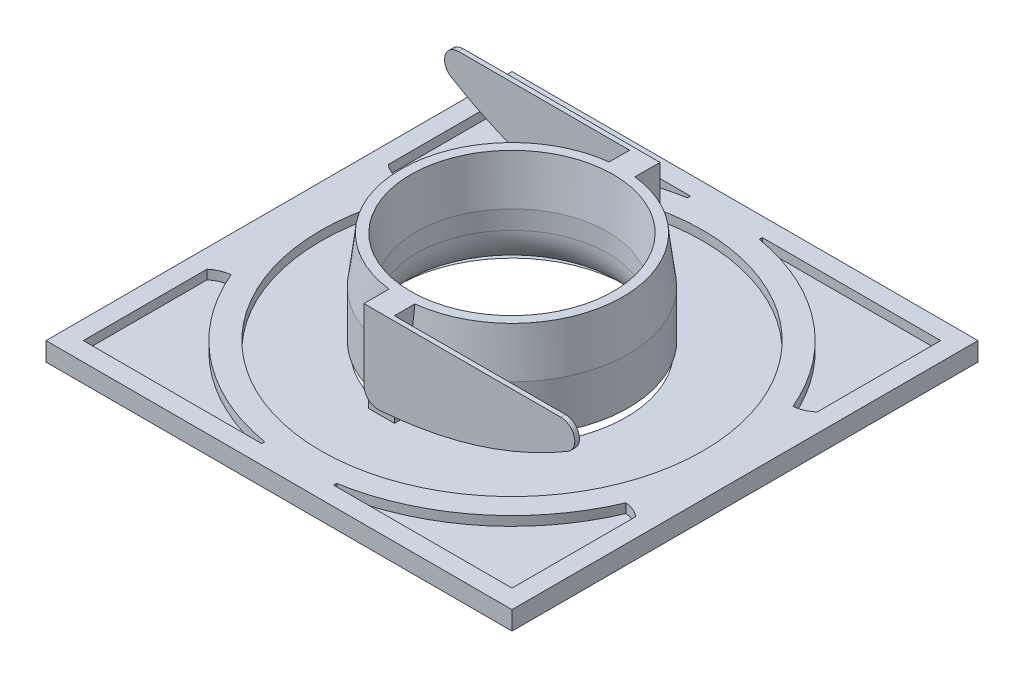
ISO-10303-21;
HEADER;
FILE_DESCRIPTION(('STEP AP214'),'2;1');
FILE_NAME('part.step','',(''),(''),'','','');
FILE_SCHEMA(('AUTOMOTIVE_DESIGN { 1 0 10303 214 1 1 1 1 }'));
ENDSEC;
DATA;
#1=APPLICATION_CONTEXT('core data for automotive mechanical design processes');
#2=APPLICATION_PROTOCOL_DEFINITION('international standard','automotive_design',2000,#1);
#3=PRODUCT_CONTEXT('',#1,'mechanical');
#4=PRODUCT('Part','Part','',(#3));
#5=PRODUCT_RELATED_PRODUCT_CATEGORY('part','',(#4));
#6=PRODUCT_DEFINITION_FORMATION('','',#4);
#7=PRODUCT_DEFINITION_CONTEXT('part definition',#1,'design');
#8=PRODUCT_DEFINITION('design','',#6,#7);
#9=PRODUCT_DEFINITION_SHAPE('','',#8);
#10=(LENGTH_UNIT() NAMED_UNIT(*) SI_UNIT(.MILLI.,.METRE.));
#11=(NAMED_UNIT(*) PLANE_ANGLE_UNIT() SI_UNIT($,.RADIAN.));
#12=(NAMED_UNIT(*) SI_UNIT($,.STERADIAN.) SOLID_ANGLE_UNIT());
#13=UNCERTAINTY_MEASURE_WITH_UNIT(LENGTH_MEASURE(1.E-05),#10,'distance_accuracy_value','');
#14=(GEOMETRIC_REPRESENTATION_CONTEXT(3) GLOBAL_UNCERTAINTY_ASSIGNED_CONTEXT((#13)) GLOBAL_UNIT_ASSIGNED_CONTEXT((#10,
#11,#12)) REPRESENTATION_CONTEXT('',''));
#15=CARTESIAN_POINT('',(0.,0.,0.));
#16=DIRECTION('',(0.,0.,1.));
#17=DIRECTION('',(1.,0.,0.));
#18=AXIS2_PLACEMENT_3D('',#15,#16,#17);
#19=CARTESIAN_POINT('',(0.,10.,0.));
#20=DIRECTION('',(0.,1.,0.));
#21=DIRECTION('',(0.,0.,1.));
#22=AXIS2_PLACEMENT_3D('',#19,#20,#21);
#23=TOROIDAL_SURFACE('',#22,30.5,10.);
#24=CARTESIAN_POINT('',(0.,0.,0.));
#25=DIRECTION('',(0.,1.,0.));
#26=DIRECTION('',(0.,0.,1.));
#27=AXIS2_PLACEMENT_3D('',#24,#25,#26);
#28=CIRCLE('',#27,30.5);
#29=CARTESIAN_POINT('',(0.,0.,30.5));
#30=VERTEX_POINT('',#29);
#31=EDGE_CURVE('E393',#30,#30,#28,.T.);
#32=ORIENTED_EDGE('',*,*,#31,.F.);
#33=EDGE_LOOP('',(#32));
#34=FACE_BOUND('',#33,.T.);
#35=CARTESIAN_POINT('',(0.,2.,0.));
#36=DIRECTION('',(0.,-1.,0.));
#37=DIRECTION('',(0.,0.,-1.));
#38=AXIS2_PLACEMENT_3D('',#35,#36,#37);
#39=CIRCLE('',#38,24.5);
#40=CARTESIAN_POINT('',(0.,2.,-24.5));
#41=VERTEX_POINT('',#40);
#42=EDGE_CURVE('E396',#41,#41,#39,.F.);
#43=ORIENTED_EDGE('',*,*,#42,.T.);
#44=EDGE_LOOP('',(#43));
#45=FACE_BOUND('',#44,.T.);
#46=ADVANCED_FACE('F49',(#34,#45),#23,.T.);
#47=CARTESIAN_POINT('',(0.,4.,0.));
#48=DIRECTION('',(0.,1.,0.));
#49=DIRECTION('',(0.,0.,1.));
#50=AXIS2_PLACEMENT_3D('',#47,#48,#49);
#51=PLANE('',#50);
#52=DIRECTION('',(1.,0.,0.));
#53=VECTOR('',#52,1.);
#54=CARTESIAN_POINT('',(7.79290084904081,4.,46.));
#55=LINE('',#54,#53);
#56=CARTESIAN_POINT('',(7.79290084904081,4.,46.));
#57=VERTEX_POINT('',#56);
#58=CARTESIAN_POINT('',(46.,4.,46.));
#59=VERTEX_POINT('',#58);
#60=EDGE_CURVE('E141',#57,#59,#55,.T.);
#61=ORIENTED_EDGE('',*,*,#60,.F.);
#62=CARTESIAN_POINT('',(8.23135517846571,4.,45.6675467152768));
#63=DIRECTION('',(0.,1.,0.));
#64=DIRECTION('',(0.,0.,1.));
#65=AXIS2_PLACEMENT_3D('',#62,#63,#64);
#66=CIRCLE('',#65,0.5502430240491);
#67=CARTESIAN_POINT('',(7.79290084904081,4.,45.3350934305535));
#68=VERTEX_POINT('',#67);
#69=EDGE_CURVE('E227',#68,#57,#66,.T.);
#70=ORIENTED_EDGE('',*,*,#69,.F.);
#71=CARTESIAN_POINT('',(0.,4.,0.));
#72=DIRECTION('',(0.,-1.,0.));
#73=DIRECTION('',(0.,0.,1.));
#74=AXIS2_PLACEMENT_3D('',#71,#72,#73);
#75=CIRCLE('',#74,46.);
#76=CARTESIAN_POINT('',(42.3681865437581,4.,17.9147081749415));
#77=VERTEX_POINT('',#76);
#78=EDGE_CURVE('E221',#77,#68,#75,.T.);
#79=ORIENTED_EDGE('',*,*,#78,.F.);
#80=CARTESIAN_POINT('',(41.7465136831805,4.,24.447397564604));
#81=DIRECTION('',(0.,1.,0.));
#82=DIRECTION('',(0.,0.,1.));
#83=AXIS2_PLACEMENT_3D('',#80,#81,#82);
#84=CIRCLE('',#83,6.56220296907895);
#85=CARTESIAN_POINT('',(46.,4.,19.4503622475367));
#86=VERTEX_POINT('',#85);
#87=EDGE_CURVE('E525',#86,#77,#84,.T.);
#88=ORIENTED_EDGE('',*,*,#87,.F.);
#89=DIRECTION('',(0.,0.,-1.));
#90=VECTOR('',#89,1.);
#91=CARTESIAN_POINT('',(46.,4.,46.));
#92=LINE('',#91,#90);
#93=EDGE_CURVE('E250',#59,#86,#92,.T.);
#94=ORIENTED_EDGE('',*,*,#93,.F.);
#95=EDGE_LOOP('',(#61,#70,#79,#88,#94));
#96=FACE_BOUND('',#95,.T.);
#97=CARTESIAN_POINT('',(0.,4.,0.));
#98=DIRECTION('',(0.,1.,0.));
#99=DIRECTION('',(0.,0.,1.));
#100=AXIS2_PLACEMENT_3D('',#97,#98,#99);
#101=CIRCLE('',#100,41.);
#102=CARTESIAN_POINT('',(0.,4.,41.));
#103=VERTEX_POINT('',#102);
#104=EDGE_CURVE('E458',#103,#103,#101,.T.);
#105=ORIENTED_EDGE('',*,*,#104,.F.);
#106=EDGE_LOOP('',(#105));
#107=FACE_BOUND('',#106,.T.);
#108=DIRECTION('',(-1.,0.,0.));
#109=VECTOR('',#108,1.);
#110=CARTESIAN_POINT('',(46.,4.,-46.));
#111=LINE('',#110,#109);
#112=CARTESIAN_POINT('',(46.,4.,-46.));
#113=VERTEX_POINT('',#112);
#114=CARTESIAN_POINT('',(7.79290084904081,4.,-46.));
#115=VERTEX_POINT('',#114);
#116=EDGE_CURVE('E295',#113,#115,#111,.T.);
#117=ORIENTED_EDGE('',*,*,#116,.F.);
#118=DIRECTION('',(0.,0.,-1.));
#119=VECTOR('',#118,1.);
#120=CARTESIAN_POINT('',(46.,4.,-19.4503622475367));
#121=LINE('',#120,#119);
#122=CARTESIAN_POINT('',(46.,4.,-19.4503622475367));
#123=VERTEX_POINT('',#122);
#124=EDGE_CURVE('E326',#123,#113,#121,.T.);
#125=ORIENTED_EDGE('',*,*,#124,.F.);
#126=CARTESIAN_POINT('',(41.7465136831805,4.,-24.447397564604));
#127=DIRECTION('',(0.,1.,0.));
#128=DIRECTION('',(0.,0.,-1.));
#129=AXIS2_PLACEMENT_3D('',#126,#127,#128);
#130=CIRCLE('',#129,6.56220296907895);
#131=CARTESIAN_POINT('',(42.3681865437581,4.,-17.9147081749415));
#132=VERTEX_POINT('',#131);
#133=EDGE_CURVE('E322',#132,#123,#130,.T.);
#134=ORIENTED_EDGE('',*,*,#133,.F.);
#135=CARTESIAN_POINT('',(0.,4.,0.));
#136=DIRECTION('',(0.,-1.,0.));
#137=DIRECTION('',(0.,0.,1.));
#138=AXIS2_PLACEMENT_3D('',#135,#136,#137);
#139=CIRCLE('',#138,46.);
#140=CARTESIAN_POINT('',(7.79290084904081,4.,-45.3350934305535));
#141=VERTEX_POINT('',#140);
#142=EDGE_CURVE('E318',#141,#132,#139,.T.);
#143=ORIENTED_EDGE('',*,*,#142,.F.);
#144=CARTESIAN_POINT('',(8.23135517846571,4.,-45.6675467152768));
#145=DIRECTION('',(0.,1.,0.));
#146=DIRECTION('',(0.,0.,-1.));
#147=AXIS2_PLACEMENT_3D('',#144,#145,#146);
#148=CIRCLE('',#147,0.5502430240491);
#149=EDGE_CURVE('E315',#115,#141,#148,.T.);
#150=ORIENTED_EDGE('',*,*,#149,.F.);
#151=EDGE_LOOP('',(#117,#125,#134,#143,#150));
#152=FACE_BOUND('',#151,.T.);
#153=DIRECTION('',(0.,0.,1.));
#154=VECTOR('',#153,1.);
#155=CARTESIAN_POINT('',(-46.,4.,19.4503622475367));
#156=LINE('',#155,#154);
#157=CARTESIAN_POINT('',(-46.,4.,19.4503622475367));
#158=VERTEX_POINT('',#157);
#159=CARTESIAN_POINT('',(-46.,4.,46.));
#160=VERTEX_POINT('',#159);
#161=EDGE_CURVE('E275',#158,#160,#156,.T.);
#162=ORIENTED_EDGE('',*,*,#161,.F.);
#163=CARTESIAN_POINT('',(-41.7465136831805,4.,24.447397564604));
#164=DIRECTION('',(0.,1.,0.));
#165=DIRECTION('',(0.,0.,-1.));
#166=AXIS2_PLACEMENT_3D('',#163,#164,#165);
#167=CIRCLE('',#166,6.56220296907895);
#168=CARTESIAN_POINT('',(-42.3681865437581,4.,17.9147081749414));
#169=VERTEX_POINT('',#168);
#170=EDGE_CURVE('E271',#169,#158,#167,.T.);
#171=ORIENTED_EDGE('',*,*,#170,.F.);
#172=CARTESIAN_POINT('',(0.,4.,0.));
#173=DIRECTION('',(0.,-1.,0.));
#174=DIRECTION('',(0.,0.,1.));
#175=AXIS2_PLACEMENT_3D('',#172,#173,#174);
#176=CIRCLE('',#175,46.);
#177=CARTESIAN_POINT('',(-7.79290084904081,4.,45.3350934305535));
#178=VERTEX_POINT('',#177);
#179=EDGE_CURVE('E267',#178,#169,#176,.T.);
#180=ORIENTED_EDGE('',*,*,#179,.F.);
#181=CARTESIAN_POINT('',(-8.23135517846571,4.,45.6675467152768));
#182=DIRECTION('',(0.,1.,0.));
#183=DIRECTION('',(0.,0.,-1.));
#184=AXIS2_PLACEMENT_3D('',#181,#182,#183);
#185=CIRCLE('',#184,0.5502430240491);
#186=CARTESIAN_POINT('',(-7.79290084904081,4.,46.));
#187=VERTEX_POINT('',#186);
#188=EDGE_CURVE('E263',#187,#178,#185,.T.);
#189=ORIENTED_EDGE('',*,*,#188,.F.);
#190=DIRECTION('',(1.,0.,0.));
#191=VECTOR('',#190,1.);
#192=CARTESIAN_POINT('',(-46.,4.,46.));
#193=LINE('',#192,#191);
#194=EDGE_CURVE('E259',#160,#187,#193,.T.);
#195=ORIENTED_EDGE('',*,*,#194,.F.);
#196=EDGE_LOOP('',(#162,#171,#180,#189,#195));
#197=FACE_BOUND('',#196,.T.);
#198=CARTESIAN_POINT('',(0.,4.,0.));
#199=DIRECTION('',(0.,-1.,0.));
#200=DIRECTION('',(0.,0.,1.));
#201=AXIS2_PLACEMENT_3D('',#198,#199,#200);
#202=CIRCLE('',#201,46.);
#203=CARTESIAN_POINT('',(-42.3681865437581,4.,-17.9147081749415));
#204=VERTEX_POINT('',#203);
#205=CARTESIAN_POINT('',(-7.79290084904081,4.,-45.3350934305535));
#206=VERTEX_POINT('',#205);
#207=EDGE_CURVE('E483',#204,#206,#202,.T.);
#208=ORIENTED_EDGE('',*,*,#207,.F.);
#209=CARTESIAN_POINT('',(-41.7465136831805,4.,-24.447397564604));
#210=DIRECTION('',(0.,1.,0.));
#211=DIRECTION('',(0.,0.,1.));
#212=AXIS2_PLACEMENT_3D('',#209,#210,#211);
#213=CIRCLE('',#212,6.56220296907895);
#214=CARTESIAN_POINT('',(-46.,4.,-19.4503622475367));
#215=VERTEX_POINT('',#214);
#216=EDGE_CURVE('E479',#215,#204,#213,.T.);
#217=ORIENTED_EDGE('',*,*,#216,.F.);
#218=DIRECTION('',(0.,0.,1.));
#219=VECTOR('',#218,1.);
#220=CARTESIAN_POINT('',(-46.,4.,-46.));
#221=LINE('',#220,#219);
#222=CARTESIAN_POINT('',(-46.,4.,-46.));
#223=VERTEX_POINT('',#222);
#224=EDGE_CURVE('E475',#223,#215,#221,.T.);
#225=ORIENTED_EDGE('',*,*,#224,.F.);
#226=DIRECTION('',(-1.,0.,0.));
#227=VECTOR('',#226,1.);
#228=CARTESIAN_POINT('',(-7.79290084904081,4.,-46.));
#229=LINE('',#228,#227);
#230=CARTESIAN_POINT('',(-7.79290084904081,4.,-46.));
#231=VERTEX_POINT('',#230);
#232=EDGE_CURVE('E471',#231,#223,#229,.T.);
#233=ORIENTED_EDGE('',*,*,#232,.F.);
#234=CARTESIAN_POINT('',(-8.23135517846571,4.,-45.6675467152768));
#235=DIRECTION('',(0.,1.,0.));
#236=DIRECTION('',(0.,0.,1.));
#237=AXIS2_PLACEMENT_3D('',#234,#235,#236);
#238=CIRCLE('',#237,0.5502430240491);
#239=EDGE_CURVE('E467',#206,#231,#238,.T.);
#240=ORIENTED_EDGE('',*,*,#239,.F.);
#241=EDGE_LOOP('',(#208,#217,#225,#233,#240));
#242=FACE_BOUND('',#241,.T.);
#243=DIRECTION('',(0.,0.,-1.));
#244=VECTOR('',#243,1.);
#245=CARTESIAN_POINT('',(50.,4.,-50.));
#246=LINE('',#245,#244);
#247=CARTESIAN_POINT('',(50.,4.,50.));
#248=VERTEX_POINT('',#247);
#249=CARTESIAN_POINT('',(50.,4.,-50.));
#250=VERTEX_POINT('',#249);
#251=EDGE_CURVE('E399',#248,#250,#246,.T.);
#252=ORIENTED_EDGE('',*,*,#251,.T.);
#253=DIRECTION('',(-1.,0.,0.));
#254=VECTOR('',#253,1.);
#255=CARTESIAN_POINT('',(-50.,4.,-50.));
#256=LINE('',#255,#254);
#257=CARTESIAN_POINT('',(-50.,4.,-50.));
#258=VERTEX_POINT('',#257);
#259=EDGE_CURVE('E403',#250,#258,#256,.T.);
#260=ORIENTED_EDGE('',*,*,#259,.T.);
#261=DIRECTION('',(0.,0.,1.));
#262=VECTOR('',#261,1.);
#263=CARTESIAN_POINT('',(-50.,4.,-50.));
#264=LINE('',#263,#262);
#265=CARTESIAN_POINT('',(-50.,4.,50.));
#266=VERTEX_POINT('',#265);
#267=EDGE_CURVE('E443',#258,#266,#264,.T.);
#268=ORIENTED_EDGE('',*,*,#267,.T.);
#269=DIRECTION('',(1.,0.,0.));
#270=VECTOR('',#269,1.);
#271=CARTESIAN_POINT('',(-50.,4.,50.));
#272=LINE('',#271,#270);
#273=EDGE_CURVE('E440',#266,#248,#272,.T.);
#274=ORIENTED_EDGE('',*,*,#273,.T.);
#275=EDGE_LOOP('',(#252,#260,#268,#274));
#276=FACE_BOUND('',#275,.T.);
#277=ADVANCED_FACE('F382',(#96,#107,#152,#197,#242,#276),#51,.T.);
#278=CARTESIAN_POINT('',(50.,4.,-50.));
#279=DIRECTION('',(-1.,0.,0.));
#280=DIRECTION('',(0.,0.,1.));
#281=AXIS2_PLACEMENT_3D('',#278,#279,#280);
#282=PLANE('',#281);
#283=DIRECTION('',(0.,0.,-1.));
#284=VECTOR('',#283,1.);
#285=CARTESIAN_POINT('',(50.,0.,-50.));
#286=LINE('',#285,#284);
#287=CARTESIAN_POINT('',(50.,0.,50.));
#288=VERTEX_POINT('',#287);
#289=CARTESIAN_POINT('',(50.,0.,-50.));
#290=VERTEX_POINT('',#289);
#291=EDGE_CURVE('E430',#288,#290,#286,.T.);
#292=ORIENTED_EDGE('',*,*,#291,.T.);
#293=DIRECTION('',(0.,-1.,0.));
#294=VECTOR('',#293,1.);
#295=CARTESIAN_POINT('',(50.,4.,-50.));
#296=LINE('',#295,#294);
#297=EDGE_CURVE('E410',#250,#290,#296,.T.);
#298=ORIENTED_EDGE('',*,*,#297,.F.);
#299=ORIENTED_EDGE('',*,*,#251,.F.);
#300=DIRECTION('',(0.,-1.,0.));
#301=VECTOR('',#300,1.);
#302=CARTESIAN_POINT('',(50.,4.,50.));
#303=LINE('',#302,#301);
#304=EDGE_CURVE('E426',#248,#288,#303,.T.);
#305=ORIENTED_EDGE('',*,*,#304,.T.);
#306=EDGE_LOOP('',(#292,#298,#299,#305));
#307=FACE_BOUND('',#306,.T.);
#308=ADVANCED_FACE('F387',(#307),#282,.F.);
#309=CARTESIAN_POINT('',(-50.,4.,-50.));
#310=DIRECTION('',(0.,0.,1.));
#311=DIRECTION('',(1.,0.,0.));
#312=AXIS2_PLACEMENT_3D('',#309,#310,#311);
#313=PLANE('',#312);
#314=DIRECTION('',(-1.,0.,0.));
#315=VECTOR('',#314,1.);
#316=CARTESIAN_POINT('',(-50.,0.,-50.));
#317=LINE('',#316,#315);
#318=CARTESIAN_POINT('',(-50.,0.,-50.));
#319=VERTEX_POINT('',#318);
#320=EDGE_CURVE('E415',#290,#319,#317,.T.);
#321=ORIENTED_EDGE('',*,*,#320,.T.);
#322=DIRECTION('',(0.,-1.,0.));
#323=VECTOR('',#322,1.);
#324=CARTESIAN_POINT('',(-50.,4.,-50.));
#325=LINE('',#324,#323);
#326=EDGE_CURVE('E416',#258,#319,#325,.T.);
#327=ORIENTED_EDGE('',*,*,#326,.F.);
#328=ORIENTED_EDGE('',*,*,#259,.F.);
#329=ORIENTED_EDGE('',*,*,#297,.T.);
#330=EDGE_LOOP('',(#321,#327,#328,#329));
#331=FACE_BOUND('',#330,.T.);
#332=ADVANCED_FACE('F618',(#331),#313,.F.);
#333=CARTESIAN_POINT('',(-50.,4.,-50.));
#334=DIRECTION('',(1.,0.,0.));
#335=DIRECTION('',(0.,0.,-1.));
#336=AXIS2_PLACEMENT_3D('',#333,#334,#335);
#337=PLANE('',#336);
#338=DIRECTION('',(0.,0.,1.));
#339=VECTOR('',#338,1.);
#340=CARTESIAN_POINT('',(-50.,0.,-50.));
#341=LINE('',#340,#339);
#342=CARTESIAN_POINT('',(-50.,0.,50.));
#343=VERTEX_POINT('',#342);
#344=EDGE_CURVE('E414',#319,#343,#341,.T.);
#345=ORIENTED_EDGE('',*,*,#344,.T.);
#346=DIRECTION('',(0.,-1.,0.));
#347=VECTOR('',#346,1.);
#348=CARTESIAN_POINT('',(-50.,4.,50.));
#349=LINE('',#348,#347);
#350=EDGE_CURVE('E421',#266,#343,#349,.T.);
#351=ORIENTED_EDGE('',*,*,#350,.F.);
#352=ORIENTED_EDGE('',*,*,#267,.F.);
#353=ORIENTED_EDGE('',*,*,#326,.T.);
#354=EDGE_LOOP('',(#345,#351,#352,#353));
#355=FACE_BOUND('',#354,.T.);
#356=ADVANCED_FACE('F623',(#355),#337,.F.);
#357=CARTESIAN_POINT('',(-50.,4.,50.));
#358=DIRECTION('',(0.,0.,-1.));
#359=DIRECTION('',(-1.,0.,0.));
#360=AXIS2_PLACEMENT_3D('',#357,#358,#359);
#361=PLANE('',#360);
#362=DIRECTION('',(1.,0.,0.));
#363=VECTOR('',#362,1.);
#364=CARTESIAN_POINT('',(-50.,0.,50.));
#365=LINE('',#364,#363);
#366=EDGE_CURVE('E420',#343,#288,#365,.T.);
#367=ORIENTED_EDGE('',*,*,#366,.T.);
#368=ORIENTED_EDGE('',*,*,#304,.F.);
#369=ORIENTED_EDGE('',*,*,#273,.F.);
#370=ORIENTED_EDGE('',*,*,#350,.T.);
#371=EDGE_LOOP('',(#367,#368,#369,#370));
#372=FACE_BOUND('',#371,.T.);
#373=ADVANCED_FACE('F626',(#372),#361,.F.);
#374=CARTESIAN_POINT('',(0.,0.,0.));
#375=DIRECTION('',(0.,1.,0.));
#376=DIRECTION('',(0.,0.,1.));
#377=AXIS2_PLACEMENT_3D('',#374,#375,#376);
#378=PLANE('',#377);
#379=CARTESIAN_POINT('',(0.,0.,0.));
#380=DIRECTION('',(0.,-1.,0.));
#381=DIRECTION('',(0.,0.,-1.));
#382=AXIS2_PLACEMENT_3D('',#379,#380,#381);
#383=CIRCLE('',#382,42.5);
#384=CARTESIAN_POINT('',(0.,0.,-42.5));
#385=VERTEX_POINT('',#384);
#386=EDGE_CURVE('E425',#385,#385,#383,.T.);
#387=ORIENTED_EDGE('',*,*,#386,.F.);
#388=EDGE_LOOP('',(#387));
#389=FACE_BOUND('',#388,.T.);
#390=ORIENTED_EDGE('',*,*,#291,.F.);
#391=ORIENTED_EDGE('',*,*,#366,.F.);
#392=ORIENTED_EDGE('',*,*,#344,.F.);
#393=ORIENTED_EDGE('',*,*,#320,.F.);
#394=EDGE_LOOP('',(#390,#391,#392,#393));
#395=FACE_BOUND('',#394,.T.);
#396=ADVANCED_FACE('F628',(#389,#395),#378,.F.);
#397=CARTESIAN_POINT('',(0.,2.,0.));
#398=DIRECTION('',(0.,-1.,0.));
#399=DIRECTION('',(0.,0.,-1.));
#400=AXIS2_PLACEMENT_3D('',#397,#398,#399);
#401=CYLINDRICAL_SURFACE('',#400,42.5);
#402=CARTESIAN_POINT('',(0.,2.,0.));
#403=DIRECTION('',(0.,-1.,0.));
#404=DIRECTION('',(0.,0.,-1.));
#405=AXIS2_PLACEMENT_3D('',#402,#403,#404);
#406=CIRCLE('',#405,42.5);
#407=CARTESIAN_POINT('',(0.,2.,-42.5));
#408=VERTEX_POINT('',#407);
#409=EDGE_CURVE('E451',#408,#408,#406,.T.);
#410=ORIENTED_EDGE('',*,*,#409,.F.);
#411=EDGE_LOOP('',(#410));
#412=FACE_BOUND('',#411,.T.);
#413=ORIENTED_EDGE('',*,*,#386,.T.);
#414=EDGE_LOOP('',(#413));
#415=FACE_BOUND('',#414,.T.);
#416=ADVANCED_FACE('F630',(#412,#415),#401,.F.);
#417=CARTESIAN_POINT('',(0.,2.,0.));
#418=DIRECTION('',(0.,-1.,0.));
#419=DIRECTION('',(0.,0.,-1.));
#420=AXIS2_PLACEMENT_3D('',#417,#418,#419);
#421=PLANE('',#420);
#422=CARTESIAN_POINT('',(0.,2.,0.));
#423=DIRECTION('',(0.,-1.,0.));
#424=DIRECTION('',(0.,0.,-1.));
#425=AXIS2_PLACEMENT_3D('',#422,#423,#424);
#426=CIRCLE('',#425,41.5);
#427=CARTESIAN_POINT('',(0.,2.,-41.5));
#428=VERTEX_POINT('',#427);
#429=EDGE_CURVE('E409',#428,#428,#426,.T.);
#430=ORIENTED_EDGE('',*,*,#429,.F.);
#431=EDGE_LOOP('',(#430));
#432=FACE_BOUND('',#431,.T.);
#433=ORIENTED_EDGE('',*,*,#409,.T.);
#434=EDGE_LOOP('',(#433));
#435=FACE_BOUND('',#434,.T.);
#436=ADVANCED_FACE('F638',(#432,#435),#421,.T.);
#437=CARTESIAN_POINT('',(0.,2.,0.));
#438=DIRECTION('',(0.,-1.,0.));
#439=DIRECTION('',(0.,0.,-1.));
#440=AXIS2_PLACEMENT_3D('',#437,#438,#439);
#441=CYLINDRICAL_SURFACE('',#440,41.5);
#442=ORIENTED_EDGE('',*,*,#429,.T.);
#443=EDGE_LOOP('',(#442));
#444=FACE_BOUND('',#443,.T.);
#445=CARTESIAN_POINT('',(0.,0.,0.));
#446=DIRECTION('',(0.,-1.,0.));
#447=DIRECTION('',(0.,0.,-1.));
#448=AXIS2_PLACEMENT_3D('',#445,#446,#447);
#449=CIRCLE('',#448,41.5);
#450=CARTESIAN_POINT('',(0.,0.,-41.5));
#451=VERTEX_POINT('',#450);
#452=EDGE_CURVE('E408',#451,#451,#449,.T.);
#453=ORIENTED_EDGE('',*,*,#452,.F.);
#454=EDGE_LOOP('',(#453));
#455=FACE_BOUND('',#454,.T.);
#456=ADVANCED_FACE('F645',(#444,#455),#441,.T.);
#457=ORIENTED_EDGE('',*,*,#31,.T.);
#458=EDGE_LOOP('',(#457));
#459=FACE_BOUND('',#458,.T.);
#460=ORIENTED_EDGE('',*,*,#452,.T.);
#461=EDGE_LOOP('',(#460));
#462=FACE_BOUND('',#461,.T.);
#463=ADVANCED_FACE('F633',(#459,#462),#378,.F.);
#464=CARTESIAN_POINT('',(0.,2.,0.));
#465=DIRECTION('',(0.,1.,0.));
#466=DIRECTION('',(0.,0.,1.));
#467=AXIS2_PLACEMENT_3D('',#464,#465,#466);
#468=CYLINDRICAL_SURFACE('',#467,41.);
#469=CARTESIAN_POINT('',(0.,2.,0.));
#470=DIRECTION('',(0.,1.,0.));
#471=DIRECTION('',(0.,0.,1.));
#472=AXIS2_PLACEMENT_3D('',#469,#470,#471);
#473=CIRCLE('',#472,41.);
#474=CARTESIAN_POINT('',(0.,2.,41.));
#475=VERTEX_POINT('',#474);
#476=EDGE_CURVE('E498',#475,#475,#473,.T.);
#477=ORIENTED_EDGE('',*,*,#476,.F.);
#478=EDGE_LOOP('',(#477));
#479=FACE_BOUND('',#478,.T.);
#480=ORIENTED_EDGE('',*,*,#104,.T.);
#481=EDGE_LOOP('',(#480));
#482=FACE_BOUND('',#481,.T.);
#483=ADVANCED_FACE('F644',(#479,#482),#468,.F.);
#484=CARTESIAN_POINT('',(0.,2.,0.));
#485=DIRECTION('',(0.,1.,0.));
#486=DIRECTION('',(0.,0.,1.));
#487=AXIS2_PLACEMENT_3D('',#484,#485,#486);
#488=PLANE('',#487);
#489=ORIENTED_EDGE('',*,*,#42,.F.);
#490=EDGE_LOOP('',(#489));
#491=FACE_BOUND('',#490,.T.);
#492=ORIENTED_EDGE('',*,*,#476,.T.);
#493=EDGE_LOOP('',(#492));
#494=FACE_BOUND('',#493,.T.);
#495=ADVANCED_FACE('F651',(#491,#494),#488,.T.);
#496=CARTESIAN_POINT('',(0.,2.,0.));
#497=DIRECTION('',(0.,1.,0.));
#498=DIRECTION('',(0.,0.,1.));
#499=AXIS2_PLACEMENT_3D('',#496,#497,#498);
#500=CYLINDRICAL_SURFACE('',#499,46.);
#501=ORIENTED_EDGE('',*,*,#207,.T.);
#502=DIRECTION('',(0.,1.,0.));
#503=VECTOR('',#502,1.);
#504=CARTESIAN_POINT('',(-7.79290084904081,2.,-45.3350934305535));
#505=LINE('',#504,#503);
#506=CARTESIAN_POINT('',(-7.79290084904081,2.,-45.3350934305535));
#507=VERTEX_POINT('',#506);
#508=EDGE_CURVE('E462',#507,#206,#505,.T.);
#509=ORIENTED_EDGE('',*,*,#508,.F.);
#510=CARTESIAN_POINT('',(0.,2.,0.));
#511=DIRECTION('',(0.,-1.,0.));
#512=DIRECTION('',(0.,0.,1.));
#513=AXIS2_PLACEMENT_3D('',#510,#511,#512);
#514=CIRCLE('',#513,46.);
#515=CARTESIAN_POINT('',(-42.3681865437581,2.,-17.9147081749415));
#516=VERTEX_POINT('',#515);
#517=EDGE_CURVE('E466',#516,#507,#514,.T.);
#518=ORIENTED_EDGE('',*,*,#517,.F.);
#519=DIRECTION('',(0.,1.,0.));
#520=VECTOR('',#519,1.);
#521=CARTESIAN_POINT('',(-42.3681865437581,2.,-17.9147081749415));
#522=LINE('',#521,#520);
#523=EDGE_CURVE('E480',#516,#204,#522,.T.);
#524=ORIENTED_EDGE('',*,*,#523,.T.);
#525=EDGE_LOOP('',(#501,#509,#518,#524));
#526=FACE_BOUND('',#525,.T.);
#527=ADVANCED_FACE('F665',(#526),#500,.T.);
#528=CARTESIAN_POINT('',(-41.7465136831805,2.,-24.447397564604));
#529=DIRECTION('',(0.,1.,0.));
#530=DIRECTION('',(0.,0.,1.));
#531=AXIS2_PLACEMENT_3D('',#528,#529,#530);
#532=CYLINDRICAL_SURFACE('',#531,6.56220296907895);
#533=ORIENTED_EDGE('',*,*,#216,.T.);
#534=ORIENTED_EDGE('',*,*,#523,.F.);
#535=CARTESIAN_POINT('',(-41.7465136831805,2.,-24.447397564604));
#536=DIRECTION('',(0.,1.,0.));
#537=DIRECTION('',(0.,0.,1.));
#538=AXIS2_PLACEMENT_3D('',#535,#536,#537);
#539=CIRCLE('',#538,6.56220296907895);
#540=CARTESIAN_POINT('',(-46.,2.,-19.4503622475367));
#541=VERTEX_POINT('',#540);
#542=EDGE_CURVE('E290',#541,#516,#539,.T.);
#543=ORIENTED_EDGE('',*,*,#542,.F.);
#544=DIRECTION('',(0.,1.,0.));
#545=VECTOR('',#544,1.);
#546=CARTESIAN_POINT('',(-46.,2.,-19.4503622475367));
#547=LINE('',#546,#545);
#548=EDGE_CURVE('E476',#541,#215,#547,.T.);
#549=ORIENTED_EDGE('',*,*,#548,.T.);
#550=EDGE_LOOP('',(#533,#534,#543,#549));
#551=FACE_BOUND('',#550,.T.);
#552=ADVANCED_FACE('F668',(#551),#532,.F.);
#553=CARTESIAN_POINT('',(-46.,2.,-46.));
#554=DIRECTION('',(-1.,0.,0.));
#555=DIRECTION('',(0.,0.,1.));
#556=AXIS2_PLACEMENT_3D('',#553,#554,#555);
#557=PLANE('',#556);
#558=ORIENTED_EDGE('',*,*,#224,.T.);
#559=ORIENTED_EDGE('',*,*,#548,.F.);
#560=DIRECTION('',(0.,0.,1.));
#561=VECTOR('',#560,1.);
#562=CARTESIAN_POINT('',(-46.,2.,-46.));
#563=LINE('',#562,#561);
#564=CARTESIAN_POINT('',(-46.,2.,-46.));
#565=VERTEX_POINT('',#564);
#566=EDGE_CURVE('E502',#565,#541,#563,.T.);
#567=ORIENTED_EDGE('',*,*,#566,.F.);
#568=DIRECTION('',(0.,1.,0.));
#569=VECTOR('',#568,1.);
#570=CARTESIAN_POINT('',(-46.,2.,-46.));
#571=LINE('',#570,#569);
#572=EDGE_CURVE('E472',#565,#223,#571,.T.);
#573=ORIENTED_EDGE('',*,*,#572,.T.);
#574=EDGE_LOOP('',(#558,#559,#567,#573));
#575=FACE_BOUND('',#574,.T.);
#576=ADVANCED_FACE('F677',(#575),#557,.F.);
#577=CARTESIAN_POINT('',(-7.79290084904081,2.,-46.));
#578=DIRECTION('',(0.,0.,-1.));
#579=DIRECTION('',(-1.,0.,0.));
#580=AXIS2_PLACEMENT_3D('',#577,#578,#579);
#581=PLANE('',#580);
#582=ORIENTED_EDGE('',*,*,#232,.T.);
#583=ORIENTED_EDGE('',*,*,#572,.F.);
#584=DIRECTION('',(-1.,0.,0.));
#585=VECTOR('',#584,1.);
#586=CARTESIAN_POINT('',(-7.79290084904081,2.,-46.));
#587=LINE('',#586,#585);
#588=CARTESIAN_POINT('',(-7.79290084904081,2.,-46.));
#589=VERTEX_POINT('',#588);
#590=EDGE_CURVE('E506',#589,#565,#587,.T.);
#591=ORIENTED_EDGE('',*,*,#590,.F.);
#592=DIRECTION('',(0.,1.,0.));
#593=VECTOR('',#592,1.);
#594=CARTESIAN_POINT('',(-7.79290084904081,2.,-46.));
#595=LINE('',#594,#593);
#596=EDGE_CURVE('E468',#589,#231,#595,.T.);
#597=ORIENTED_EDGE('',*,*,#596,.T.);
#598=EDGE_LOOP('',(#582,#583,#591,#597));
#599=FACE_BOUND('',#598,.T.);
#600=ADVANCED_FACE('F673',(#599),#581,.F.);
#601=CARTESIAN_POINT('',(-8.23135517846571,2.,-45.6675467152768));
#602=DIRECTION('',(0.,1.,0.));
#603=DIRECTION('',(0.,0.,1.));
#604=AXIS2_PLACEMENT_3D('',#601,#602,#603);
#605=CYLINDRICAL_SURFACE('',#604,0.5502430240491);
#606=ORIENTED_EDGE('',*,*,#239,.T.);
#607=ORIENTED_EDGE('',*,*,#596,.F.);
#608=CARTESIAN_POINT('',(-8.23135517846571,2.,-45.6675467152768));
#609=DIRECTION('',(0.,1.,0.));
#610=DIRECTION('',(0.,0.,1.));
#611=AXIS2_PLACEMENT_3D('',#608,#609,#610);
#612=CIRCLE('',#611,0.5502430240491);
#613=EDGE_CURVE('E510',#507,#589,#612,.T.);
#614=ORIENTED_EDGE('',*,*,#613,.F.);
#615=ORIENTED_EDGE('',*,*,#508,.T.);
#616=EDGE_LOOP('',(#606,#607,#614,#615));
#617=FACE_BOUND('',#616,.T.);
#618=ADVANCED_FACE('F670',(#617),#605,.F.);
#619=CARTESIAN_POINT('',(0.,2.,0.));
#620=DIRECTION('',(0.,1.,0.));
#621=DIRECTION('',(0.,0.,1.));
#622=AXIS2_PLACEMENT_3D('',#619,#620,#621);
#623=PLANE('',#622);
#624=ORIENTED_EDGE('',*,*,#517,.T.);
#625=ORIENTED_EDGE('',*,*,#613,.T.);
#626=ORIENTED_EDGE('',*,*,#590,.T.);
#627=ORIENTED_EDGE('',*,*,#566,.T.);
#628=ORIENTED_EDGE('',*,*,#542,.T.);
#629=EDGE_LOOP('',(#624,#625,#626,#627,#628));
#630=FACE_BOUND('',#629,.T.);
#631=ADVANCED_FACE('F565',(#630),#623,.T.);
#632=CARTESIAN_POINT('',(-46.,2.,19.4503622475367));
#633=DIRECTION('',(-1.,0.,0.));
#634=DIRECTION('',(0.,0.,1.));
#635=AXIS2_PLACEMENT_3D('',#632,#633,#634);
#636=PLANE('',#635);
#637=ORIENTED_EDGE('',*,*,#161,.T.);
#638=DIRECTION('',(0.,1.,0.));
#639=VECTOR('',#638,1.);
#640=CARTESIAN_POINT('',(-46.,2.,46.));
#641=LINE('',#640,#639);
#642=CARTESIAN_POINT('',(-46.,2.,46.));
#643=VERTEX_POINT('',#642);
#644=EDGE_CURVE('E254',#643,#160,#641,.T.);
#645=ORIENTED_EDGE('',*,*,#644,.F.);
#646=DIRECTION('',(0.,0.,1.));
#647=VECTOR('',#646,1.);
#648=CARTESIAN_POINT('',(-46.,2.,19.4503622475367));
#649=LINE('',#648,#647);
#650=CARTESIAN_POINT('',(-46.,2.,19.4503622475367));
#651=VERTEX_POINT('',#650);
#652=EDGE_CURVE('E258',#651,#643,#649,.T.);
#653=ORIENTED_EDGE('',*,*,#652,.F.);
#654=DIRECTION('',(0.,1.,0.));
#655=VECTOR('',#654,1.);
#656=CARTESIAN_POINT('',(-46.,2.,19.4503622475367));
#657=LINE('',#656,#655);
#658=EDGE_CURVE('E272',#651,#158,#657,.T.);
#659=ORIENTED_EDGE('',*,*,#658,.T.);
#660=EDGE_LOOP('',(#637,#645,#653,#659));
#661=FACE_BOUND('',#660,.T.);
#662=ADVANCED_FACE('F561',(#661),#636,.F.);
#663=CARTESIAN_POINT('',(-41.7465136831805,2.,24.447397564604));
#664=DIRECTION('',(0.,1.,0.));
#665=DIRECTION('',(0.,0.,1.));
#666=AXIS2_PLACEMENT_3D('',#663,#664,#665);
#667=CYLINDRICAL_SURFACE('',#666,6.56220296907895);
#668=ORIENTED_EDGE('',*,*,#170,.T.);
#669=ORIENTED_EDGE('',*,*,#658,.F.);
#670=CARTESIAN_POINT('',(-41.7465136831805,2.,24.447397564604));
#671=DIRECTION('',(0.,1.,0.));
#672=DIRECTION('',(0.,0.,-1.));
#673=AXIS2_PLACEMENT_3D('',#670,#671,#672);
#674=CIRCLE('',#673,6.56220296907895);
#675=CARTESIAN_POINT('',(-42.3681865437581,2.,17.9147081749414));
#676=VERTEX_POINT('',#675);
#677=EDGE_CURVE('E291',#676,#651,#674,.T.);
#678=ORIENTED_EDGE('',*,*,#677,.F.);
#679=DIRECTION('',(0.,1.,0.));
#680=VECTOR('',#679,1.);
#681=CARTESIAN_POINT('',(-42.3681865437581,2.,17.9147081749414));
#682=LINE('',#681,#680);
#683=EDGE_CURVE('E268',#676,#169,#682,.T.);
#684=ORIENTED_EDGE('',*,*,#683,.T.);
#685=EDGE_LOOP('',(#668,#669,#678,#684));
#686=FACE_BOUND('',#685,.T.);
#687=ADVANCED_FACE('F564',(#686),#667,.F.);
#688=CARTESIAN_POINT('',(0.,2.,0.));
#689=DIRECTION('',(0.,1.,0.));
#690=DIRECTION('',(0.,0.,1.));
#691=AXIS2_PLACEMENT_3D('',#688,#689,#690);
#692=CYLINDRICAL_SURFACE('',#691,46.);
#693=ORIENTED_EDGE('',*,*,#179,.T.);
#694=ORIENTED_EDGE('',*,*,#683,.F.);
#695=CARTESIAN_POINT('',(0.,2.,0.));
#696=DIRECTION('',(0.,-1.,0.));
#697=DIRECTION('',(0.,0.,1.));
#698=AXIS2_PLACEMENT_3D('',#695,#696,#697);
#699=CIRCLE('',#698,46.);
#700=CARTESIAN_POINT('',(-7.79290084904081,2.,45.3350934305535));
#701=VERTEX_POINT('',#700);
#702=EDGE_CURVE('E296',#701,#676,#699,.T.);
#703=ORIENTED_EDGE('',*,*,#702,.F.);
#704=DIRECTION('',(0.,1.,0.));
#705=VECTOR('',#704,1.);
#706=CARTESIAN_POINT('',(-7.79290084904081,2.,45.3350934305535));
#707=LINE('',#706,#705);
#708=EDGE_CURVE('E264',#701,#178,#707,.T.);
#709=ORIENTED_EDGE('',*,*,#708,.T.);
#710=EDGE_LOOP('',(#693,#694,#703,#709));
#711=FACE_BOUND('',#710,.T.);
#712=ADVANCED_FACE('F575',(#711),#692,.T.);
#713=CARTESIAN_POINT('',(-8.23135517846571,2.,45.6675467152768));
#714=DIRECTION('',(0.,1.,0.));
#715=DIRECTION('',(0.,0.,1.));
#716=AXIS2_PLACEMENT_3D('',#713,#714,#715);
#717=CYLINDRICAL_SURFACE('',#716,0.5502430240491);
#718=ORIENTED_EDGE('',*,*,#188,.T.);
#719=ORIENTED_EDGE('',*,*,#708,.F.);
#720=CARTESIAN_POINT('',(-8.23135517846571,2.,45.6675467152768));
#721=DIRECTION('',(0.,1.,0.));
#722=DIRECTION('',(0.,0.,-1.));
#723=AXIS2_PLACEMENT_3D('',#720,#721,#722);
#724=CIRCLE('',#723,0.5502430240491);
#725=CARTESIAN_POINT('',(-7.79290084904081,2.,46.));
#726=VERTEX_POINT('',#725);
#727=EDGE_CURVE('E300',#726,#701,#724,.T.);
#728=ORIENTED_EDGE('',*,*,#727,.F.);
#729=DIRECTION('',(0.,1.,0.));
#730=VECTOR('',#729,1.);
#731=CARTESIAN_POINT('',(-7.79290084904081,2.,46.));
#732=LINE('',#731,#730);
#733=EDGE_CURVE('E260',#726,#187,#732,.T.);
#734=ORIENTED_EDGE('',*,*,#733,.T.);
#735=EDGE_LOOP('',(#718,#719,#728,#734));
#736=FACE_BOUND('',#735,.T.);
#737=ADVANCED_FACE('F571',(#736),#717,.F.);
#738=CARTESIAN_POINT('',(-46.,2.,46.));
#739=DIRECTION('',(0.,0.,1.));
#740=DIRECTION('',(1.,0.,0.));
#741=AXIS2_PLACEMENT_3D('',#738,#739,#740);
#742=PLANE('',#741);
#743=ORIENTED_EDGE('',*,*,#194,.T.);
#744=ORIENTED_EDGE('',*,*,#733,.F.);
#745=DIRECTION('',(1.,0.,0.));
#746=VECTOR('',#745,1.);
#747=CARTESIAN_POINT('',(-46.,2.,46.));
#748=LINE('',#747,#746);
#749=EDGE_CURVE('E304',#643,#726,#748,.T.);
#750=ORIENTED_EDGE('',*,*,#749,.F.);
#751=ORIENTED_EDGE('',*,*,#644,.T.);
#752=EDGE_LOOP('',(#743,#744,#750,#751));
#753=FACE_BOUND('',#752,.T.);
#754=ADVANCED_FACE('F567',(#753),#742,.F.);
#755=CARTESIAN_POINT('',(-8.23135517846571,2.,45.6675467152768));
#756=DIRECTION('',(0.,-1.,0.));
#757=DIRECTION('',(0.,0.,-1.));
#758=AXIS2_PLACEMENT_3D('',#755,#756,#757);
#759=PLANE('',#758);
#760=ORIENTED_EDGE('',*,*,#652,.T.);
#761=ORIENTED_EDGE('',*,*,#749,.T.);
#762=ORIENTED_EDGE('',*,*,#727,.T.);
#763=ORIENTED_EDGE('',*,*,#702,.T.);
#764=ORIENTED_EDGE('',*,*,#677,.T.);
#765=EDGE_LOOP('',(#760,#761,#762,#763,#764));
#766=FACE_BOUND('',#765,.T.);
#767=ADVANCED_FACE('F570',(#766),#759,.F.);
#768=CARTESIAN_POINT('',(46.,2.,-46.));
#769=DIRECTION('',(0.,0.,-1.));
#770=DIRECTION('',(-1.,0.,0.));
#771=AXIS2_PLACEMENT_3D('',#768,#769,#770);
#772=PLANE('',#771);
#773=ORIENTED_EDGE('',*,*,#116,.T.);
#774=DIRECTION('',(0.,1.,0.));
#775=VECTOR('',#774,1.);
#776=CARTESIAN_POINT('',(7.79290084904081,2.,-46.));
#777=LINE('',#776,#775);
#778=CARTESIAN_POINT('',(7.79290084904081,2.,-46.));
#779=VERTEX_POINT('',#778);
#780=EDGE_CURVE('E311',#779,#115,#777,.T.);
#781=ORIENTED_EDGE('',*,*,#780,.F.);
#782=DIRECTION('',(-1.,0.,0.));
#783=VECTOR('',#782,1.);
#784=CARTESIAN_POINT('',(46.,2.,-46.));
#785=LINE('',#784,#783);
#786=CARTESIAN_POINT('',(46.,2.,-46.));
#787=VERTEX_POINT('',#786);
#788=EDGE_CURVE('E52',#787,#779,#785,.T.);
#789=ORIENTED_EDGE('',*,*,#788,.F.);
#790=DIRECTION('',(0.,1.,0.));
#791=VECTOR('',#790,1.);
#792=CARTESIAN_POINT('',(46.,2.,-46.));
#793=LINE('',#792,#791);
#794=EDGE_CURVE('E327',#787,#113,#793,.T.);
#795=ORIENTED_EDGE('',*,*,#794,.T.);
#796=EDGE_LOOP('',(#773,#781,#789,#795));
#797=FACE_BOUND('',#796,.T.);
#798=ADVANCED_FACE('F365',(#797),#772,.F.);
#799=CARTESIAN_POINT('',(46.,2.,-19.4503622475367));
#800=DIRECTION('',(1.,0.,0.));
#801=DIRECTION('',(0.,0.,-1.));
#802=AXIS2_PLACEMENT_3D('',#799,#800,#801);
#803=PLANE('',#802);
#804=ORIENTED_EDGE('',*,*,#124,.T.);
#805=ORIENTED_EDGE('',*,*,#794,.F.);
#806=DIRECTION('',(0.,0.,-1.));
#807=VECTOR('',#806,1.);
#808=CARTESIAN_POINT('',(46.,2.,-19.4503622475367));
#809=LINE('',#808,#807);
#810=CARTESIAN_POINT('',(46.,2.,-19.4503622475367));
#811=VERTEX_POINT('',#810);
#812=EDGE_CURVE('E343',#811,#787,#809,.T.);
#813=ORIENTED_EDGE('',*,*,#812,.F.);
#814=DIRECTION('',(0.,1.,0.));
#815=VECTOR('',#814,1.);
#816=CARTESIAN_POINT('',(46.,2.,-19.4503622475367));
#817=LINE('',#816,#815);
#818=EDGE_CURVE('E323',#811,#123,#817,.T.);
#819=ORIENTED_EDGE('',*,*,#818,.T.);
#820=EDGE_LOOP('',(#804,#805,#813,#819));
#821=FACE_BOUND('',#820,.T.);
#822=ADVANCED_FACE('F586',(#821),#803,.F.);
#823=CARTESIAN_POINT('',(41.7465136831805,2.,-24.447397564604));
#824=DIRECTION('',(0.,1.,0.));
#825=DIRECTION('',(0.,0.,1.));
#826=AXIS2_PLACEMENT_3D('',#823,#824,#825);
#827=CYLINDRICAL_SURFACE('',#826,6.56220296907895);
#828=ORIENTED_EDGE('',*,*,#133,.T.);
#829=ORIENTED_EDGE('',*,*,#818,.F.);
#830=CARTESIAN_POINT('',(41.7465136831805,2.,-24.447397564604));
#831=DIRECTION('',(0.,1.,0.));
#832=DIRECTION('',(0.,0.,-1.));
#833=AXIS2_PLACEMENT_3D('',#830,#831,#832);
#834=CIRCLE('',#833,6.56220296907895);
#835=CARTESIAN_POINT('',(42.3681865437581,2.,-17.9147081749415));
#836=VERTEX_POINT('',#835);
#837=EDGE_CURVE('E347',#836,#811,#834,.T.);
#838=ORIENTED_EDGE('',*,*,#837,.F.);
#839=DIRECTION('',(0.,1.,0.));
#840=VECTOR('',#839,1.);
#841=CARTESIAN_POINT('',(42.3681865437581,2.,-17.9147081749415));
#842=LINE('',#841,#840);
#843=EDGE_CURVE('E319',#836,#132,#842,.T.);
#844=ORIENTED_EDGE('',*,*,#843,.T.);
#845=EDGE_LOOP('',(#828,#829,#838,#844));
#846=FACE_BOUND('',#845,.T.);
#847=ADVANCED_FACE('F377',(#846),#827,.F.);
#848=CARTESIAN_POINT('',(0.,2.,0.));
#849=DIRECTION('',(0.,1.,0.));
#850=DIRECTION('',(0.,0.,1.));
#851=AXIS2_PLACEMENT_3D('',#848,#849,#850);
#852=CYLINDRICAL_SURFACE('',#851,46.);
#853=ORIENTED_EDGE('',*,*,#142,.T.);
#854=ORIENTED_EDGE('',*,*,#843,.F.);
#855=CARTESIAN_POINT('',(0.,2.,0.));
#856=DIRECTION('',(0.,-1.,0.));
#857=DIRECTION('',(0.,0.,1.));
#858=AXIS2_PLACEMENT_3D('',#855,#856,#857);
#859=CIRCLE('',#858,46.);
#860=CARTESIAN_POINT('',(7.79290084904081,2.,-45.3350934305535));
#861=VERTEX_POINT('',#860);
#862=EDGE_CURVE('E351',#861,#836,#859,.T.);
#863=ORIENTED_EDGE('',*,*,#862,.F.);
#864=DIRECTION('',(0.,1.,0.));
#865=VECTOR('',#864,1.);
#866=CARTESIAN_POINT('',(7.79290084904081,2.,-45.3350934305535));
#867=LINE('',#866,#865);
#868=EDGE_CURVE('E134',#861,#141,#867,.T.);
#869=ORIENTED_EDGE('',*,*,#868,.T.);
#870=EDGE_LOOP('',(#853,#854,#863,#869));
#871=FACE_BOUND('',#870,.T.);
#872=ADVANCED_FACE('F371',(#871),#852,.T.);
#873=CARTESIAN_POINT('',(8.23135517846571,2.,-45.6675467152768));
#874=DIRECTION('',(0.,1.,0.));
#875=DIRECTION('',(0.,0.,1.));
#876=AXIS2_PLACEMENT_3D('',#873,#874,#875);
#877=CYLINDRICAL_SURFACE('',#876,0.5502430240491);
#878=ORIENTED_EDGE('',*,*,#149,.T.);
#879=ORIENTED_EDGE('',*,*,#868,.F.);
#880=CARTESIAN_POINT('',(8.23135517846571,2.,-45.6675467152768));
#881=DIRECTION('',(0.,1.,0.));
#882=DIRECTION('',(0.,0.,-1.));
#883=AXIS2_PLACEMENT_3D('',#880,#881,#882);
#884=CIRCLE('',#883,0.5502430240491);
#885=EDGE_CURVE('E354',#779,#861,#884,.T.);
#886=ORIENTED_EDGE('',*,*,#885,.F.);
#887=ORIENTED_EDGE('',*,*,#780,.T.);
#888=EDGE_LOOP('',(#878,#879,#886,#887));
#889=FACE_BOUND('',#888,.T.);
#890=ADVANCED_FACE('F368',(#889),#877,.F.);
#891=CARTESIAN_POINT('',(8.23135517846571,2.,-45.6675467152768));
#892=DIRECTION('',(0.,-1.,0.));
#893=DIRECTION('',(0.,0.,-1.));
#894=AXIS2_PLACEMENT_3D('',#891,#892,#893);
#895=PLANE('',#894);
#896=ORIENTED_EDGE('',*,*,#788,.T.);
#897=ORIENTED_EDGE('',*,*,#885,.T.);
#898=ORIENTED_EDGE('',*,*,#862,.T.);
#899=ORIENTED_EDGE('',*,*,#837,.T.);
#900=ORIENTED_EDGE('',*,*,#812,.T.);
#901=EDGE_LOOP('',(#896,#897,#898,#899,#900));
#902=FACE_BOUND('',#901,.T.);
#903=ADVANCED_FACE('F361',(#902),#895,.F.);
#904=CARTESIAN_POINT('',(7.79290084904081,2.,46.));
#905=DIRECTION('',(0.,0.,1.));
#906=DIRECTION('',(1.,0.,0.));
#907=AXIS2_PLACEMENT_3D('',#904,#905,#906);
#908=PLANE('',#907);
#909=ORIENTED_EDGE('',*,*,#60,.T.);
#910=DIRECTION('',(0.,1.,0.));
#911=VECTOR('',#910,1.);
#912=CARTESIAN_POINT('',(46.,2.,46.));
#913=LINE('',#912,#911);
#914=CARTESIAN_POINT('',(46.,2.,46.));
#915=VERTEX_POINT('',#914);
#916=EDGE_CURVE('E243',#915,#59,#913,.T.);
#917=ORIENTED_EDGE('',*,*,#916,.F.);
#918=DIRECTION('',(1.,0.,0.));
#919=VECTOR('',#918,1.);
#920=CARTESIAN_POINT('',(7.79290084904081,2.,46.));
#921=LINE('',#920,#919);
#922=CARTESIAN_POINT('',(7.79290084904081,2.,46.));
#923=VERTEX_POINT('',#922);
#924=EDGE_CURVE('E241',#923,#915,#921,.T.);
#925=ORIENTED_EDGE('',*,*,#924,.F.);
#926=DIRECTION('',(0.,1.,0.));
#927=VECTOR('',#926,1.);
#928=CARTESIAN_POINT('',(7.79290084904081,2.,46.));
#929=LINE('',#928,#927);
#930=EDGE_CURVE('E237',#923,#57,#929,.T.);
#931=ORIENTED_EDGE('',*,*,#930,.T.);
#932=EDGE_LOOP('',(#909,#917,#925,#931));
#933=FACE_BOUND('',#932,.T.);
#934=ADVANCED_FACE('F242',(#933),#908,.F.);
#935=CARTESIAN_POINT('',(8.23135517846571,2.,45.6675467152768));
#936=DIRECTION('',(0.,1.,0.));
#937=DIRECTION('',(0.,0.,1.));
#938=AXIS2_PLACEMENT_3D('',#935,#936,#937);
#939=CYLINDRICAL_SURFACE('',#938,0.5502430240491);
#940=ORIENTED_EDGE('',*,*,#69,.T.);
#941=ORIENTED_EDGE('',*,*,#930,.F.);
#942=CARTESIAN_POINT('',(8.23135517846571,2.,45.6675467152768));
#943=DIRECTION('',(0.,1.,0.));
#944=DIRECTION('',(0.,0.,1.));
#945=AXIS2_PLACEMENT_3D('',#942,#943,#944);
#946=CIRCLE('',#945,0.5502430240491);
#947=CARTESIAN_POINT('',(7.79290084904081,2.,45.3350934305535));
#948=VERTEX_POINT('',#947);
#949=EDGE_CURVE('E12',#948,#923,#946,.T.);
#950=ORIENTED_EDGE('',*,*,#949,.F.);
#951=DIRECTION('',(0.,1.,0.));
#952=VECTOR('',#951,1.);
#953=CARTESIAN_POINT('',(7.79290084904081,2.,45.3350934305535));
#954=LINE('',#953,#952);
#955=EDGE_CURVE('E216',#948,#68,#954,.T.);
#956=ORIENTED_EDGE('',*,*,#955,.T.);
#957=EDGE_LOOP('',(#940,#941,#950,#956));
#958=FACE_BOUND('',#957,.T.);
#959=ADVANCED_FACE('F236',(#958),#939,.F.);
#960=CARTESIAN_POINT('',(0.,2.,0.));
#961=DIRECTION('',(0.,1.,0.));
#962=DIRECTION('',(0.,0.,1.));
#963=AXIS2_PLACEMENT_3D('',#960,#961,#962);
#964=CYLINDRICAL_SURFACE('',#963,46.);
#965=ORIENTED_EDGE('',*,*,#78,.T.);
#966=ORIENTED_EDGE('',*,*,#955,.F.);
#967=CARTESIAN_POINT('',(0.,2.,0.));
#968=DIRECTION('',(0.,-1.,0.));
#969=DIRECTION('',(0.,0.,1.));
#970=AXIS2_PLACEMENT_3D('',#967,#968,#969);
#971=CIRCLE('',#970,46.);
#972=CARTESIAN_POINT('',(42.3681865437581,2.,17.9147081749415));
#973=VERTEX_POINT('',#972);
#974=EDGE_CURVE('E59',#973,#948,#971,.T.);
#975=ORIENTED_EDGE('',*,*,#974,.F.);
#976=DIRECTION('',(0.,1.,0.));
#977=VECTOR('',#976,1.);
#978=CARTESIAN_POINT('',(42.3681865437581,2.,17.9147081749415));
#979=LINE('',#978,#977);
#980=EDGE_CURVE('E526',#973,#77,#979,.T.);
#981=ORIENTED_EDGE('',*,*,#980,.T.);
#982=EDGE_LOOP('',(#965,#966,#975,#981));
#983=FACE_BOUND('',#982,.T.);
#984=ADVANCED_FACE('F218',(#983),#964,.T.);
#985=CARTESIAN_POINT('',(41.7465136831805,2.,24.447397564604));
#986=DIRECTION('',(0.,1.,0.));
#987=DIRECTION('',(0.,0.,1.));
#988=AXIS2_PLACEMENT_3D('',#985,#986,#987);
#989=CYLINDRICAL_SURFACE('',#988,6.56220296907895);
#990=ORIENTED_EDGE('',*,*,#87,.T.);
#991=ORIENTED_EDGE('',*,*,#980,.F.);
#992=CARTESIAN_POINT('',(41.7465136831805,2.,24.447397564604));
#993=DIRECTION('',(0.,1.,0.));
#994=DIRECTION('',(0.,0.,1.));
#995=AXIS2_PLACEMENT_3D('',#992,#993,#994);
#996=CIRCLE('',#995,6.56220296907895);
#997=CARTESIAN_POINT('',(46.,2.,19.4503622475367));
#998=VERTEX_POINT('',#997);
#999=EDGE_CURVE('E233',#998,#973,#996,.T.);
#1000=ORIENTED_EDGE('',*,*,#999,.F.);
#1001=DIRECTION('',(0.,1.,0.));
#1002=VECTOR('',#1001,1.);
#1003=CARTESIAN_POINT('',(46.,2.,19.4503622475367));
#1004=LINE('',#1003,#1002);
#1005=EDGE_CURVE('E68',#998,#86,#1004,.T.);
#1006=ORIENTED_EDGE('',*,*,#1005,.T.);
#1007=EDGE_LOOP('',(#990,#991,#1000,#1006));
#1008=FACE_BOUND('',#1007,.T.);
#1009=ADVANCED_FACE('F546',(#1008),#989,.F.);
#1010=CARTESIAN_POINT('',(46.,2.,46.));
#1011=DIRECTION('',(1.,0.,0.));
#1012=DIRECTION('',(0.,0.,-1.));
#1013=AXIS2_PLACEMENT_3D('',#1010,#1011,#1012);
#1014=PLANE('',#1013);
#1015=ORIENTED_EDGE('',*,*,#93,.T.);
#1016=ORIENTED_EDGE('',*,*,#1005,.F.);
#1017=DIRECTION('',(0.,0.,-1.));
#1018=VECTOR('',#1017,1.);
#1019=CARTESIAN_POINT('',(46.,2.,46.));
#1020=LINE('',#1019,#1018);
#1021=EDGE_CURVE('E245',#915,#998,#1020,.T.);
#1022=ORIENTED_EDGE('',*,*,#1021,.F.);
#1023=ORIENTED_EDGE('',*,*,#916,.T.);
#1024=EDGE_LOOP('',(#1015,#1016,#1022,#1023));
#1025=FACE_BOUND('',#1024,.T.);
#1026=ADVANCED_FACE('F542',(#1025),#1014,.F.);
#1027=CARTESIAN_POINT('',(41.7465136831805,2.,24.447397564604));
#1028=DIRECTION('',(0.,1.,0.));
#1029=DIRECTION('',(0.,0.,1.));
#1030=AXIS2_PLACEMENT_3D('',#1027,#1028,#1029);
#1031=PLANE('',#1030);
#1032=ORIENTED_EDGE('',*,*,#924,.T.);
#1033=ORIENTED_EDGE('',*,*,#1021,.T.);
#1034=ORIENTED_EDGE('',*,*,#999,.T.);
#1035=ORIENTED_EDGE('',*,*,#974,.T.);
#1036=ORIENTED_EDGE('',*,*,#949,.T.);
#1037=EDGE_LOOP('',(#1032,#1033,#1034,#1035,#1036));
#1038=FACE_BOUND('',#1037,.T.);
#1039=ADVANCED_FACE('F231',(#1038),#1031,.T.);
#1040=CLOSED_SHELL('',(#46,#277,#308,#332,#356,#373,#396,#416,#436,#456,#463,#483,#495,#527,
#552,#576,#600,#618,#631,#662,#687,#712,#737,#754,#767,#798,#822,#847,#872,#890,#903,#934,#959,
#984,#1009,#1026,#1039));
#1041=MANIFOLD_SOLID_BREP('B2',#1040);
#1042=CARTESIAN_POINT('',(0.,4.,0.));
#1043=DIRECTION('',(0.,-1.,0.));
#1044=DIRECTION('',(0.,0.,-1.));
#1045=AXIS2_PLACEMENT_3D('',#1042,#1043,#1044);
#1046=CYLINDRICAL_SURFACE('',#1045,20.5);
#1047=CARTESIAN_POINT('',(0.,10.,0.));
#1048=DIRECTION('',(0.,1.,0.));
#1049=DIRECTION('',(0.,0.,1.));
#1050=AXIS2_PLACEMENT_3D('',#1047,#1048,#1049);
#1051=CIRCLE('',#1050,20.5);
#1052=CARTESIAN_POINT('',(0.,10.,20.5));
#1053=VERTEX_POINT('',#1052);
#1054=EDGE_CURVE('E47',#1053,#1053,#1051,.F.);
#1055=ORIENTED_EDGE('',*,*,#1054,.T.);
#1056=EDGE_LOOP('',(#1055));
#1057=FACE_BOUND('',#1056,.T.);
#1058=CARTESIAN_POINT('',(0.,14.,0.));
#1059=DIRECTION('',(0.,1.,0.));
#1060=DIRECTION('',(0.,0.,1.));
#1061=AXIS2_PLACEMENT_3D('',#1058,#1059,#1060);
#1062=CIRCLE('',#1061,20.5);
#1063=CARTESIAN_POINT('',(0.,14.,20.5));
#1064=VERTEX_POINT('',#1063);
#1065=EDGE_CURVE('E1095',#1064,#1064,#1062,.T.);
#1066=ORIENTED_EDGE('',*,*,#1065,.T.);
#1067=EDGE_LOOP('',(#1066));
#1068=FACE_BOUND('',#1067,.T.);
#1069=ADVANCED_FACE('F927',(#1057,#1068),#1046,.F.);
#1070=CARTESIAN_POINT('',(0.,10.,0.));
#1071=DIRECTION('',(0.,1.,0.));
#1072=DIRECTION('',(0.,0.,1.));
#1073=AXIS2_PLACEMENT_3D('',#1070,#1071,#1072);
#1074=TOROIDAL_SURFACE('',#1073,30.5,10.);
#1075=CARTESIAN_POINT('',(0.,4.,0.));
#1076=DIRECTION('',(0.,-1.,0.));
#1077=DIRECTION('',(0.,0.,-1.));
#1078=AXIS2_PLACEMENT_3D('',#1075,#1076,#1077);
#1079=CIRCLE('',#1078,22.5);
#1080=CARTESIAN_POINT('',(0.,4.,-22.5));
#1081=VERTEX_POINT('',#1080);
#1082=EDGE_CURVE('E1360',#1081,#1081,#1079,.F.);
#1083=ORIENTED_EDGE('',*,*,#1082,.F.);
#1084=EDGE_LOOP('',(#1083));
#1085=FACE_BOUND('',#1084,.T.);
#1086=ORIENTED_EDGE('',*,*,#1054,.F.);
#1087=EDGE_LOOP('',(#1086));
#1088=FACE_BOUND('',#1087,.T.);
#1089=ADVANCED_FACE('F929',(#1085,#1088),#1074,.T.);
#1090=CARTESIAN_POINT('',(0.,14.,0.));
#1091=DIRECTION('',(0.,1.,0.));
#1092=DIRECTION('',(0.,0.,1.));
#1093=AXIS2_PLACEMENT_3D('',#1090,#1091,#1092);
#1094=CONICAL_SURFACE('',#1093,20.5,0.122173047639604);
#1095=CARTESIAN_POINT('',(0.,24.,0.));
#1096=DIRECTION('',(0.,1.,0.));
#1097=DIRECTION('',(0.,0.,1.));
#1098=AXIS2_PLACEMENT_3D('',#1095,#1096,#1097);
#1099=CIRCLE('',#1098,21.7278456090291);
#1100=CARTESIAN_POINT('',(0.,24.,21.7278456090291));
#1101=VERTEX_POINT('',#1100);
#1102=EDGE_CURVE('E1091',#1101,#1101,#1099,.T.);
#1103=ORIENTED_EDGE('',*,*,#1102,.T.);
#1104=EDGE_LOOP('',(#1103));
#1105=FACE_BOUND('',#1104,.T.);
#1106=ORIENTED_EDGE('',*,*,#1065,.F.);
#1107=EDGE_LOOP('',(#1106));
#1108=FACE_BOUND('',#1107,.T.);
#1109=ADVANCED_FACE('F1222',(#1105,#1108),#1094,.F.);
#1110=CARTESIAN_POINT('',(39.4737740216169,21.,29.));
#1111=DIRECTION('',(0.,0.,-1.));
#1112=DIRECTION('',(-1.,0.,0.));
#1113=AXIS2_PLACEMENT_3D('',#1110,#1111,#1112);
#1114=CYLINDRICAL_SURFACE('',#1113,3.);
#1115=CARTESIAN_POINT('',(39.4737740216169,21.,28.));
#1116=DIRECTION('',(0.,0.,1.));
#1117=DIRECTION('',(1.,0.,0.));
#1118=AXIS2_PLACEMENT_3D('',#1115,#1116,#1117);
#1119=CIRCLE('',#1118,3.);
#1120=CARTESIAN_POINT('',(41.0026045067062,18.4187837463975,28.));
#1121=VERTEX_POINT('',#1120);
#1122=CARTESIAN_POINT('',(39.4737740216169,24.,28.));
#1123=VERTEX_POINT('',#1122);
#1124=EDGE_CURVE('E1165',#1121,#1123,#1119,.T.);
#1125=ORIENTED_EDGE('',*,*,#1124,.T.);
#1126=DIRECTION('',(0.,0.,-1.));
#1127=VECTOR('',#1126,1.);
#1128=CARTESIAN_POINT('',(39.4737740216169,24.,29.));
#1129=LINE('',#1128,#1127);
#1130=CARTESIAN_POINT('',(39.4737740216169,24.,29.));
#1131=VERTEX_POINT('',#1130);
#1132=EDGE_CURVE('E1157',#1131,#1123,#1129,.T.);
#1133=ORIENTED_EDGE('',*,*,#1132,.F.);
#1134=CARTESIAN_POINT('',(39.4737740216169,21.,29.));
#1135=DIRECTION('',(0.,0.,1.));
#1136=DIRECTION('',(1.,0.,0.));
#1137=AXIS2_PLACEMENT_3D('',#1134,#1135,#1136);
#1138=CIRCLE('',#1137,3.);
#1139=CARTESIAN_POINT('',(41.0026045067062,18.4187837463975,29.));
#1140=VERTEX_POINT('',#1139);
#1141=EDGE_CURVE('E1182',#1140,#1131,#1138,.T.);
#1142=ORIENTED_EDGE('',*,*,#1141,.F.);
#1143=DIRECTION('',(0.,0.,-1.));
#1144=VECTOR('',#1143,1.);
#1145=CARTESIAN_POINT('',(41.0026045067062,18.4187837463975,29.));
#1146=LINE('',#1145,#1144);
#1147=EDGE_CURVE('E1154',#1140,#1121,#1146,.T.);
#1148=ORIENTED_EDGE('',*,*,#1147,.T.);
#1149=EDGE_LOOP('',(#1125,#1133,#1142,#1148));
#1150=FACE_BOUND('',#1149,.T.);
#1151=ADVANCED_FACE('F1201',(#1150),#1114,.T.);
#1152=CARTESIAN_POINT('',(-39.4737740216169,21.,-29.));
#1153=DIRECTION('',(0.,0.,1.));
#1154=DIRECTION('',(1.,0.,0.));
#1155=AXIS2_PLACEMENT_3D('',#1152,#1153,#1154);
#1156=CYLINDRICAL_SURFACE('',#1155,3.);
#1157=CARTESIAN_POINT('',(-39.4737740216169,21.,-28.));
#1158=DIRECTION('',(0.,0.,-1.));
#1159=DIRECTION('',(-1.,0.,0.));
#1160=AXIS2_PLACEMENT_3D('',#1157,#1158,#1159);
#1161=CIRCLE('',#1160,3.);
#1162=CARTESIAN_POINT('',(-41.0026045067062,18.4187837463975,-28.));
#1163=VERTEX_POINT('',#1162);
#1164=CARTESIAN_POINT('',(-39.4737740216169,24.,-28.));
#1165=VERTEX_POINT('',#1164);
#1166=EDGE_CURVE('E1350',#1163,#1165,#1161,.T.);
#1167=ORIENTED_EDGE('',*,*,#1166,.T.);
#1168=DIRECTION('',(0.,0.,1.));
#1169=VECTOR('',#1168,1.);
#1170=CARTESIAN_POINT('',(-39.4737740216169,24.,-29.));
#1171=LINE('',#1170,#1169);
#1172=CARTESIAN_POINT('',(-39.4737740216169,24.,-29.));
#1173=VERTEX_POINT('',#1172);
#1174=EDGE_CURVE('E1342',#1173,#1165,#1171,.T.);
#1175=ORIENTED_EDGE('',*,*,#1174,.F.);
#1176=CARTESIAN_POINT('',(-39.4737740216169,21.,-29.));
#1177=DIRECTION('',(0.,0.,-1.));
#1178=DIRECTION('',(-1.,0.,0.));
#1179=AXIS2_PLACEMENT_3D('',#1176,#1177,#1178);
#1180=CIRCLE('',#1179,3.);
#1181=CARTESIAN_POINT('',(-41.0026045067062,18.4187837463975,-29.));
#1182=VERTEX_POINT('',#1181);
#1183=EDGE_CURVE('E1362',#1182,#1173,#1180,.T.);
#1184=ORIENTED_EDGE('',*,*,#1183,.F.);
#1185=DIRECTION('',(0.,0.,1.));
#1186=VECTOR('',#1185,1.);
#1187=CARTESIAN_POINT('',(-41.0026045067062,18.4187837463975,-29.));
#1188=LINE('',#1187,#1186);
#1189=EDGE_CURVE('E1337',#1182,#1163,#1188,.T.);
#1190=ORIENTED_EDGE('',*,*,#1189,.T.);
#1191=EDGE_LOOP('',(#1167,#1175,#1184,#1190));
#1192=FACE_BOUND('',#1191,.T.);
#1193=ADVANCED_FACE('F1375',(#1192),#1156,.T.);
#1194=CARTESIAN_POINT('',(-0.458531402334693,5.83224269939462,-29.));
#1195=CARTESIAN_POINT('',(-10.7179837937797,6.59460307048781,-29.));
#1196=CARTESIAN_POINT('',(-24.5031199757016,9.81769893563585,-29.));
#1197=CARTESIAN_POINT('',(-37.290731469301,16.220275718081,-29.));
#1198=CARTESIAN_POINT('',(-41.0026045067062,18.4187837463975,-29.));
#1199=B_SPLINE_CURVE_WITH_KNOTS('',3,(#1194,#1195,#1196,#1197,#1198),.UNSPECIFIED.,.F.,.F.,(4,1,
4),(0.0556710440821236,0.590546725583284,0.821788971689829),.UNSPECIFIED.);
#1200=DIRECTION('',(0.,0.,1.));
#1201=VECTOR('',#1200,1.);
#1202=SURFACE_OF_LINEAR_EXTRUSION('',#1199,#1201);
#1203=CARTESIAN_POINT('',(-0.458531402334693,5.83224269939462,-28.));
#1204=CARTESIAN_POINT('',(-10.7179837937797,6.59460307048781,-28.));
#1205=CARTESIAN_POINT('',(-24.5031199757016,9.81769893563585,-28.));
#1206=CARTESIAN_POINT('',(-37.290731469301,16.220275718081,-28.));
#1207=CARTESIAN_POINT('',(-41.0026045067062,18.4187837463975,-28.));
#1208=B_SPLINE_CURVE_WITH_KNOTS('',3,(#1203,#1204,#1205,#1206,#1207),.UNSPECIFIED.,.F.,.F.,(4,1,
4),(0.0556710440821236,0.590546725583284,0.821788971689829),.UNSPECIFIED.);
#1209=CARTESIAN_POINT('',(-0.458531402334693,5.83224269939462,-28.));
#1210=VERTEX_POINT('',#1209);
#1211=CARTESIAN_POINT('',(-2.76377996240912,6.02963836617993,-28.));
#1212=VERTEX_POINT('',#1211);
#1213=EDGE_CURVE('E942',#1210,#1212,#1208,.T.);
#1214=ORIENTED_EDGE('',*,*,#1213,.T.);
#1215=EDGE_CURVE('E1355',#1212,#1163,#1208,.T.);
#1216=ORIENTED_EDGE('',*,*,#1215,.T.);
#1217=ORIENTED_EDGE('',*,*,#1189,.F.);
#1218=CARTESIAN_POINT('',(-0.458531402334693,5.83224269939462,-29.));
#1219=VERTEX_POINT('',#1218);
#1220=EDGE_CURVE('E1364',#1219,#1182,#1199,.T.);
#1221=ORIENTED_EDGE('',*,*,#1220,.F.);
#1222=DIRECTION('',(0.,0.,1.));
#1223=VECTOR('',#1222,1.);
#1224=CARTESIAN_POINT('',(-0.458531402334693,5.83224269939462,-29.));
#1225=LINE('',#1224,#1223);
#1226=EDGE_CURVE('E1336',#1219,#1210,#1225,.T.);
#1227=ORIENTED_EDGE('',*,*,#1226,.T.);
#1228=EDGE_LOOP('',(#1214,#1216,#1217,#1221,#1227));
#1229=FACE_BOUND('',#1228,.T.);
#1230=ADVANCED_FACE('F1199',(#1229),#1202,.F.);
#1231=CARTESIAN_POINT('',(0.458531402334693,5.83224269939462,29.));
#1232=CARTESIAN_POINT('',(10.7179837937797,6.59460307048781,29.));
#1233=CARTESIAN_POINT('',(24.5031199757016,9.81769893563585,29.));
#1234=CARTESIAN_POINT('',(37.290731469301,16.220275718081,29.));
#1235=CARTESIAN_POINT('',(41.0026045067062,18.4187837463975,29.));
#1236=B_SPLINE_CURVE_WITH_KNOTS('',3,(#1231,#1232,#1233,#1234,#1235),.UNSPECIFIED.,.F.,.F.,(4,1,
4),(0.0556710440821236,0.590546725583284,0.821788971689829),.UNSPECIFIED.);
#1237=DIRECTION('',(0.,0.,-1.));
#1238=VECTOR('',#1237,1.);
#1239=SURFACE_OF_LINEAR_EXTRUSION('',#1236,#1238);
#1240=CARTESIAN_POINT('',(0.458531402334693,5.83224269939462,28.));
#1241=CARTESIAN_POINT('',(10.7179837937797,6.59460307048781,28.));
#1242=CARTESIAN_POINT('',(24.5031199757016,9.81769893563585,28.));
#1243=CARTESIAN_POINT('',(37.290731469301,16.220275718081,28.));
#1244=CARTESIAN_POINT('',(41.0026045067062,18.4187837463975,28.));
#1245=B_SPLINE_CURVE_WITH_KNOTS('',3,(#1240,#1241,#1242,#1243,#1244),.UNSPECIFIED.,.F.,.F.,(4,1,
4),(0.0556710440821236,0.590546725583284,0.821788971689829),.UNSPECIFIED.);
#1246=CARTESIAN_POINT('',(0.458531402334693,5.83224269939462,28.));
#1247=VERTEX_POINT('',#1246);
#1248=CARTESIAN_POINT('',(2.76377996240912,6.02963836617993,28.));
#1249=VERTEX_POINT('',#1248);
#1250=EDGE_CURVE('E1167',#1247,#1249,#1245,.T.);
#1251=ORIENTED_EDGE('',*,*,#1250,.T.);
#1252=EDGE_CURVE('E1172',#1249,#1121,#1245,.T.);
#1253=ORIENTED_EDGE('',*,*,#1252,.T.);
#1254=ORIENTED_EDGE('',*,*,#1147,.F.);
#1255=CARTESIAN_POINT('',(0.458531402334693,5.83224269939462,29.));
#1256=VERTEX_POINT('',#1255);
#1257=EDGE_CURVE('E1184',#1256,#1140,#1236,.T.);
#1258=ORIENTED_EDGE('',*,*,#1257,.F.);
#1259=DIRECTION('',(0.,0.,-1.));
#1260=VECTOR('',#1259,1.);
#1261=CARTESIAN_POINT('',(0.458531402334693,5.83224269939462,29.));
#1262=LINE('',#1261,#1260);
#1263=EDGE_CURVE('E1151',#1256,#1247,#1262,.T.);
#1264=ORIENTED_EDGE('',*,*,#1263,.T.);
#1265=EDGE_LOOP('',(#1251,#1253,#1254,#1258,#1264));
#1266=FACE_BOUND('',#1265,.T.);
#1267=ADVANCED_FACE('F1195',(#1266),#1239,.F.);
#1268=CARTESIAN_POINT('',(0.236220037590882,8.8239943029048,28.));
#1269=DIRECTION('',(0.,0.,-1.));
#1270=DIRECTION('',(-1.,0.,0.));
#1271=AXIS2_PLACEMENT_3D('',#1268,#1269,#1270);
#1272=PLANE('',#1271);
#1273=ORIENTED_EDGE('',*,*,#1252,.F.);
#1274=DIRECTION('',(0.,1.,0.));
#1275=VECTOR('',#1274,1.);
#1276=CARTESIAN_POINT('',(2.76377996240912,4.,28.));
#1277=LINE('',#1276,#1275);
#1278=CARTESIAN_POINT('',(2.76377996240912,24.,28.));
#1279=VERTEX_POINT('',#1278);
#1280=EDGE_CURVE('E1144',#1249,#1279,#1277,.T.);
#1281=ORIENTED_EDGE('',*,*,#1280,.T.);
#1282=DIRECTION('',(-1.,0.,0.));
#1283=VECTOR('',#1282,1.);
#1284=CARTESIAN_POINT('',(-2.76377996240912,24.,28.));
#1285=LINE('',#1284,#1283);
#1286=EDGE_CURVE('E1161',#1123,#1279,#1285,.T.);
#1287=ORIENTED_EDGE('',*,*,#1286,.F.);
#1288=ORIENTED_EDGE('',*,*,#1124,.F.);
#1289=EDGE_LOOP('',(#1273,#1281,#1287,#1288));
#1290=FACE_BOUND('',#1289,.T.);
#1291=ADVANCED_FACE('F1198',(#1290),#1272,.T.);
#1292=CARTESIAN_POINT('',(0.236220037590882,8.8239943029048,29.));
#1293=DIRECTION('',(0.,0.,-1.));
#1294=DIRECTION('',(-1.,0.,0.));
#1295=AXIS2_PLACEMENT_3D('',#1292,#1293,#1294);
#1296=PLANE('',#1295);
#1297=DIRECTION('',(0.,-1.,0.));
#1298=VECTOR('',#1297,1.);
#1299=CARTESIAN_POINT('',(-2.76377996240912,24.,29.));
#1300=LINE('',#1299,#1298);
#1301=CARTESIAN_POINT('',(-2.76377996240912,24.,29.));
#1302=VERTEX_POINT('',#1301);
#1303=CARTESIAN_POINT('',(-2.76377996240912,8.8239943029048,29.));
#1304=VERTEX_POINT('',#1303);
#1305=EDGE_CURVE('E1164',#1302,#1304,#1300,.T.);
#1306=ORIENTED_EDGE('',*,*,#1305,.T.);
#1307=CARTESIAN_POINT('',(0.236220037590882,8.8239943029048,29.));
#1308=DIRECTION('',(0.,0.,1.));
#1309=DIRECTION('',(-1.,0.,0.));
#1310=AXIS2_PLACEMENT_3D('',#1307,#1308,#1309);
#1311=CIRCLE('',#1310,3.);
#1312=EDGE_CURVE('E1189',#1304,#1256,#1311,.T.);
#1313=ORIENTED_EDGE('',*,*,#1312,.T.);
#1314=ORIENTED_EDGE('',*,*,#1257,.T.);
#1315=ORIENTED_EDGE('',*,*,#1141,.T.);
#1316=DIRECTION('',(-1.,0.,0.));
#1317=VECTOR('',#1316,1.);
#1318=CARTESIAN_POINT('',(-2.76377996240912,24.,29.));
#1319=LINE('',#1318,#1317);
#1320=EDGE_CURVE('E1160',#1131,#1302,#1319,.T.);
#1321=ORIENTED_EDGE('',*,*,#1320,.T.);
#1322=EDGE_LOOP('',(#1306,#1313,#1314,#1315,#1321));
#1323=FACE_BOUND('',#1322,.T.);
#1324=ADVANCED_FACE('F1206',(#1323),#1296,.F.);
#1325=CARTESIAN_POINT('',(0.236220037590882,8.8239943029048,29.));
#1326=DIRECTION('',(0.,0.,-1.));
#1327=DIRECTION('',(-1.,0.,0.));
#1328=AXIS2_PLACEMENT_3D('',#1325,#1326,#1327);
#1329=CYLINDRICAL_SURFACE('',#1328,3.);
#1330=CARTESIAN_POINT('',(0.236220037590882,8.8239943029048,28.));
#1331=DIRECTION('',(0.,0.,1.));
#1332=DIRECTION('',(-1.,0.,0.));
#1333=AXIS2_PLACEMENT_3D('',#1330,#1331,#1332);
#1334=CIRCLE('',#1333,3.);
#1335=CARTESIAN_POINT('',(-2.76377996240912,8.8239943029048,28.));
#1336=VERTEX_POINT('',#1335);
#1337=EDGE_CURVE('E1173',#1336,#1247,#1334,.T.);
#1338=ORIENTED_EDGE('',*,*,#1337,.T.);
#1339=ORIENTED_EDGE('',*,*,#1263,.F.);
#1340=ORIENTED_EDGE('',*,*,#1312,.F.);
#1341=DIRECTION('',(0.,0.,-1.));
#1342=VECTOR('',#1341,1.);
#1343=CARTESIAN_POINT('',(-2.76377996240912,8.8239943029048,29.));
#1344=LINE('',#1343,#1342);
#1345=EDGE_CURVE('E1121',#1304,#1336,#1344,.T.);
#1346=ORIENTED_EDGE('',*,*,#1345,.T.);
#1347=EDGE_LOOP('',(#1338,#1339,#1340,#1346));
#1348=FACE_BOUND('',#1347,.T.);
#1349=ADVANCED_FACE('F1203',(#1348),#1329,.T.);
#1350=CARTESIAN_POINT('',(-0.236220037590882,8.8239943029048,-28.));
#1351=DIRECTION('',(0.,0.,1.));
#1352=DIRECTION('',(1.,0.,0.));
#1353=AXIS2_PLACEMENT_3D('',#1350,#1351,#1352);
#1354=PLANE('',#1353);
#1355=ORIENTED_EDGE('',*,*,#1215,.F.);
#1356=DIRECTION('',(0.,1.,0.));
#1357=VECTOR('',#1356,1.);
#1358=CARTESIAN_POINT('',(-2.76377996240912,4.,-28.));
#1359=LINE('',#1358,#1357);
#1360=CARTESIAN_POINT('',(-2.76377996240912,24.,-28.));
#1361=VERTEX_POINT('',#1360);
#1362=EDGE_CURVE('E950',#1212,#1361,#1359,.T.);
#1363=ORIENTED_EDGE('',*,*,#1362,.T.);
#1364=DIRECTION('',(1.,0.,0.));
#1365=VECTOR('',#1364,1.);
#1366=CARTESIAN_POINT('',(2.76377996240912,24.,-28.));
#1367=LINE('',#1366,#1365);
#1368=EDGE_CURVE('E1346',#1165,#1361,#1367,.T.);
#1369=ORIENTED_EDGE('',*,*,#1368,.F.);
#1370=ORIENTED_EDGE('',*,*,#1166,.F.);
#1371=EDGE_LOOP('',(#1355,#1363,#1369,#1370));
#1372=FACE_BOUND('',#1371,.T.);
#1373=ADVANCED_FACE('F1205',(#1372),#1354,.T.);
#1374=CARTESIAN_POINT('',(0.,14.,0.));
#1375=DIRECTION('',(0.,-1.,0.));
#1376=DIRECTION('',(0.,0.,1.));
#1377=AXIS2_PLACEMENT_3D('',#1374,#1375,#1376);
#1378=CONICAL_SURFACE('',#1377,25.,0.122173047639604);
#1379=CARTESIAN_POINT('',(0.,24.,0.));
#1380=DIRECTION('',(0.,1.,0.));
#1381=DIRECTION('',(0.,0.,1.));
#1382=AXIS2_PLACEMENT_3D('',#1379,#1380,#1381);
#1383=CIRCLE('',#1382,23.7721543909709);
#1384=CARTESIAN_POINT('',(-2.76377996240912,24.,-23.6109475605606));
#1385=VERTEX_POINT('',#1384);
#1386=CARTESIAN_POINT('',(-2.76377996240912,24.,23.6109475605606));
#1387=VERTEX_POINT('',#1386);
#1388=EDGE_CURVE('E1094',#1385,#1387,#1383,.T.);
#1389=ORIENTED_EDGE('',*,*,#1388,.F.);
#1390=CARTESIAN_POINT('',(-2.76377996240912,-23.3342959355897,-29.4546943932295));
#1391=CARTESIAN_POINT('',(-2.76377996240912,-16.1672687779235,-28.5708098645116));
#1392=CARTESIAN_POINT('',(-2.76377996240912,-9.00027941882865,-27.6866185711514));
#1393=CARTESIAN_POINT('',(-2.76377996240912,5.33358587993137,-25.9173191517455));
#1394=CARTESIAN_POINT('',(-2.76377996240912,12.5004618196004,-25.0322110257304));
#1395=CARTESIAN_POINT('',(-2.76377996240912,26.8340630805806,-23.260774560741));
#1396=CARTESIAN_POINT('',(-2.76377996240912,34.0007884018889,-22.3744462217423));
#1397=CARTESIAN_POINT('',(-2.76377996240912,44.7507147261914,-21.0436468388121));
#1398=CARTESIAN_POINT('',(-2.76377996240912,48.3339966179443,-20.5998292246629));
#1399=CARTESIAN_POINT('',(-2.76377996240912,55.5004940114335,-19.7116581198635));
#1400=CARTESIAN_POINT('',(-2.76377996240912,59.0837095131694,-19.2673046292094));
#1401=CARTESIAN_POINT('',(-2.76377996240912,62.6668855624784,-18.8226330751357));
#1402=B_SPLINE_CURVE_WITH_KNOTS('',3,(#1390,#1391,#1392,#1393,#1394,#1395,#1396,#1397,#1398,
#1399,#1400,#1401),.UNSPECIFIED.,.F.,.F.,(4,2,2,2,2,4),(0.,21.6639740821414,43.3279474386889,
64.9919212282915,75.8239084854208,86.6558958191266),.UNSPECIFIED.);
#1403=CARTESIAN_POINT('',(-2.76377996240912,14.,-24.846760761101));
#1404=VERTEX_POINT('',#1403);
#1405=EDGE_CURVE('E1070',#1404,#1385,#1402,.T.);
#1406=ORIENTED_EDGE('',*,*,#1405,.F.);
#1407=CARTESIAN_POINT('',(0.,14.,0.));
#1408=DIRECTION('',(0.,1.,0.));
#1409=DIRECTION('',(0.,0.,1.));
#1410=AXIS2_PLACEMENT_3D('',#1407,#1408,#1409);
#1411=CIRCLE('',#1410,25.);
#1412=CARTESIAN_POINT('',(-2.76377996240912,14.,24.846760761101));
#1413=VERTEX_POINT('',#1412);
#1414=EDGE_CURVE('E1085',#1404,#1413,#1411,.T.);
#1415=ORIENTED_EDGE('',*,*,#1414,.T.);
#1416=CARTESIAN_POINT('',(-2.76377996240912,62.6687282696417,18.8224043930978));
#1417=CARTESIAN_POINT('',(-2.76377996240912,57.0592166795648,19.5185244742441));
#1418=CARTESIAN_POINT('',(-2.76377996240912,51.4496122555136,20.2138958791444));
#1419=CARTESIAN_POINT('',(-2.76377996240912,40.2302569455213,21.6034554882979));
#1420=CARTESIAN_POINT('',(-2.76377996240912,34.6205060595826,22.2976436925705));
#1421=CARTESIAN_POINT('',(-2.76377996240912,25.8970223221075,23.3764600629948));
#1422=CARTESIAN_POINT('',(-2.76377996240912,22.7833266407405,23.7613888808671));
#1423=CARTESIAN_POINT('',(-2.76377996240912,12.5029015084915,25.0319121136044));
#1424=CARTESIAN_POINT('',(-2.76377996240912,5.33611052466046,25.9170086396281));
#1425=CARTESIAN_POINT('',(-2.76377996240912,-8.99758457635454,27.6862848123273));
#1426=CARTESIAN_POINT('',(-2.76377996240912,-16.1644886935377,28.5704644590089));
#1427=CARTESIAN_POINT('',(-2.76377996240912,-23.331430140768,29.4543409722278));
#1428=B_SPLINE_CURVE_WITH_KNOTS('',3,(#1416,#1417,#1418,#1419,#1420,#1421,#1422,#1423,#1424,
#1425,#1426,#1427),.UNSPECIFIED.,.F.,.F.,(4,2,2,2,2,4),(0.,16.9576185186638,33.9152367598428,
43.3274330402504,64.9911491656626,86.6548651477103),.UNSPECIFIED.);
#1429=EDGE_CURVE('E1111',#1387,#1413,#1428,.T.);
#1430=ORIENTED_EDGE('',*,*,#1429,.F.);
#1431=EDGE_LOOP('',(#1389,#1406,#1415,#1430));
#1432=FACE_BOUND('',#1431,.T.);
#1433=ADVANCED_FACE('F1212',(#1432),#1378,.T.);
#1434=CARTESIAN_POINT('',(0.,24.,0.));
#1435=DIRECTION('',(0.,1.,0.));
#1436=DIRECTION('',(0.,0.,1.));
#1437=AXIS2_PLACEMENT_3D('',#1434,#1435,#1436);
#1438=PLANE('',#1437);
#1439=CARTESIAN_POINT('',(2.76377996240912,24.,23.6109475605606));
#1440=VERTEX_POINT('',#1439);
#1441=CARTESIAN_POINT('',(2.76377996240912,24.,-23.6109475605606));
#1442=VERTEX_POINT('',#1441);
#1443=EDGE_CURVE('E1089',#1440,#1442,#1383,.T.);
#1444=ORIENTED_EDGE('',*,*,#1443,.T.);
#1445=DIRECTION('',(0.,0.,-1.));
#1446=VECTOR('',#1445,1.);
#1447=CARTESIAN_POINT('',(2.76377996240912,24.,50.002));
#1448=LINE('',#1447,#1446);
#1449=CARTESIAN_POINT('',(2.76377996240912,24.,-29.));
#1450=VERTEX_POINT('',#1449);
#1451=EDGE_CURVE('E1254',#1442,#1450,#1448,.T.);
#1452=ORIENTED_EDGE('',*,*,#1451,.T.);
#1453=DIRECTION('',(1.,0.,0.));
#1454=VECTOR('',#1453,1.);
#1455=CARTESIAN_POINT('',(2.76377996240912,24.,-29.));
#1456=LINE('',#1455,#1454);
#1457=EDGE_CURVE('E1345',#1173,#1450,#1456,.T.);
#1458=ORIENTED_EDGE('',*,*,#1457,.F.);
#1459=ORIENTED_EDGE('',*,*,#1174,.T.);
#1460=ORIENTED_EDGE('',*,*,#1368,.T.);
#1461=DIRECTION('',(0.,0.,-1.));
#1462=VECTOR('',#1461,1.);
#1463=CARTESIAN_POINT('',(-2.76377996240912,24.,50.002));
#1464=LINE('',#1463,#1462);
#1465=EDGE_CURVE('E1294',#1385,#1361,#1464,.T.);
#1466=ORIENTED_EDGE('',*,*,#1465,.F.);
#1467=ORIENTED_EDGE('',*,*,#1388,.T.);
#1468=DIRECTION('',(0.,0.,1.));
#1469=VECTOR('',#1468,1.);
#1470=CARTESIAN_POINT('',(-2.76377996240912,24.,-50.002));
#1471=LINE('',#1470,#1469);
#1472=EDGE_CURVE('E1108',#1387,#1302,#1471,.T.);
#1473=ORIENTED_EDGE('',*,*,#1472,.T.);
#1474=ORIENTED_EDGE('',*,*,#1320,.F.);
#1475=ORIENTED_EDGE('',*,*,#1132,.T.);
#1476=ORIENTED_EDGE('',*,*,#1286,.T.);
#1477=DIRECTION('',(0.,0.,1.));
#1478=VECTOR('',#1477,1.);
#1479=CARTESIAN_POINT('',(2.76377996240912,24.,-50.002));
#1480=LINE('',#1479,#1478);
#1481=EDGE_CURVE('E1106',#1440,#1279,#1480,.T.);
#1482=ORIENTED_EDGE('',*,*,#1481,.F.);
#1483=EDGE_LOOP('',(#1444,#1452,#1458,#1459,#1460,#1466,#1467,#1473,#1474,#1475,#1476,#1482));
#1484=FACE_BOUND('',#1483,.T.);
#1485=ORIENTED_EDGE('',*,*,#1102,.F.);
#1486=EDGE_LOOP('',(#1485));
#1487=FACE_BOUND('',#1486,.T.);
#1488=ADVANCED_FACE('F1236',(#1484,#1487),#1438,.T.);
#1489=CARTESIAN_POINT('',(-0.236220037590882,8.8239943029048,-29.));
#1490=DIRECTION('',(0.,0.,1.));
#1491=DIRECTION('',(1.,0.,0.));
#1492=AXIS2_PLACEMENT_3D('',#1489,#1490,#1491);
#1493=PLANE('',#1492);
#1494=DIRECTION('',(0.,-1.,0.));
#1495=VECTOR('',#1494,1.);
#1496=CARTESIAN_POINT('',(2.76377996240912,24.,-29.));
#1497=LINE('',#1496,#1495);
#1498=CARTESIAN_POINT('',(2.76377996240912,8.8239943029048,-29.));
#1499=VERTEX_POINT('',#1498);
#1500=EDGE_CURVE('E1349',#1450,#1499,#1497,.T.);
#1501=ORIENTED_EDGE('',*,*,#1500,.T.);
#1502=CARTESIAN_POINT('',(-0.236220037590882,8.8239943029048,-29.));
#1503=DIRECTION('',(0.,0.,-1.));
#1504=DIRECTION('',(1.,0.,0.));
#1505=AXIS2_PLACEMENT_3D('',#1502,#1503,#1504);
#1506=CIRCLE('',#1505,3.);
#1507=EDGE_CURVE('E1334',#1499,#1219,#1506,.T.);
#1508=ORIENTED_EDGE('',*,*,#1507,.T.);
#1509=ORIENTED_EDGE('',*,*,#1220,.T.);
#1510=ORIENTED_EDGE('',*,*,#1183,.T.);
#1511=ORIENTED_EDGE('',*,*,#1457,.T.);
#1512=EDGE_LOOP('',(#1501,#1508,#1509,#1510,#1511));
#1513=FACE_BOUND('',#1512,.T.);
#1514=ADVANCED_FACE('F1238',(#1513),#1493,.F.);
#1515=CARTESIAN_POINT('',(-0.236220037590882,8.8239943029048,-29.));
#1516=DIRECTION('',(0.,0.,1.));
#1517=DIRECTION('',(1.,0.,0.));
#1518=AXIS2_PLACEMENT_3D('',#1515,#1516,#1517);
#1519=CYLINDRICAL_SURFACE('',#1518,3.);
#1520=CARTESIAN_POINT('',(-0.236220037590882,8.8239943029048,-28.));
#1521=DIRECTION('',(0.,0.,-1.));
#1522=DIRECTION('',(1.,0.,0.));
#1523=AXIS2_PLACEMENT_3D('',#1520,#1521,#1522);
#1524=CIRCLE('',#1523,3.);
#1525=CARTESIAN_POINT('',(2.76377996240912,8.8239943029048,-28.));
#1526=VERTEX_POINT('',#1525);
#1527=EDGE_CURVE('E1327',#1526,#1210,#1524,.T.);
#1528=ORIENTED_EDGE('',*,*,#1527,.T.);
#1529=ORIENTED_EDGE('',*,*,#1226,.F.);
#1530=ORIENTED_EDGE('',*,*,#1507,.F.);
#1531=DIRECTION('',(0.,0.,1.));
#1532=VECTOR('',#1531,1.);
#1533=CARTESIAN_POINT('',(2.76377996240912,8.8239943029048,-29.));
#1534=LINE('',#1533,#1532);
#1535=EDGE_CURVE('E1080',#1499,#1526,#1534,.T.);
#1536=ORIENTED_EDGE('',*,*,#1535,.T.);
#1537=EDGE_LOOP('',(#1528,#1529,#1530,#1536));
#1538=FACE_BOUND('',#1537,.T.);
#1539=ADVANCED_FACE('F1234',(#1538),#1519,.T.);
#1540=CARTESIAN_POINT('',(2.76377996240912,14.,24.846760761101));
#1541=VERTEX_POINT('',#1540);
#1542=CARTESIAN_POINT('',(2.76377996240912,14.,-24.846760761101));
#1543=VERTEX_POINT('',#1542);
#1544=EDGE_CURVE('E935',#1541,#1543,#1411,.T.);
#1545=ORIENTED_EDGE('',*,*,#1544,.T.);
#1546=CARTESIAN_POINT('',(2.76377996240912,62.6668855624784,-18.8226330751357));
#1547=CARTESIAN_POINT('',(2.76377996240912,57.057307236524,-19.5187612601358));
#1548=CARTESIAN_POINT('',(2.76377996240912,51.4476360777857,-20.2141407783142));
#1549=CARTESIAN_POINT('',(2.76377996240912,40.2281473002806,-21.6037166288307));
#1550=CARTESIAN_POINT('',(2.76377996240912,34.6183296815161,-22.2979129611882));
#1551=CARTESIAN_POINT('',(2.76377996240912,25.8947421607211,-23.3767419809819));
#1552=CARTESIAN_POINT('',(2.76377996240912,22.7810094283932,-23.7616753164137));
#1553=CARTESIAN_POINT('',(2.76377996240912,12.5004619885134,-25.032213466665));
#1554=CARTESIAN_POINT('',(2.76377996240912,5.33358574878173,-25.917320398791));
#1555=CARTESIAN_POINT('',(2.76377996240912,-9.00027986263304,-27.6866173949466));
#1556=CARTESIAN_POINT('',(2.76377996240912,-16.1672692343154,-28.5708074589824));
#1557=CARTESIAN_POINT('',(2.76377996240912,-23.3342959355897,-29.4546943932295));
#1558=B_SPLINE_CURVE_WITH_KNOTS('',3,(#1546,#1547,#1548,#1549,#1550,#1551,#1552,#1553,#1554,
#1555,#1556,#1557),.UNSPECIFIED.,.F.,.F.,(4,2,2,2,2,4),(0.,16.9578201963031,33.9156401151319,
43.327948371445,64.9919221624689,86.6558958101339),.UNSPECIFIED.);
#1559=EDGE_CURVE('E1076',#1442,#1543,#1558,.T.);
#1560=ORIENTED_EDGE('',*,*,#1559,.F.);
#1561=ORIENTED_EDGE('',*,*,#1443,.F.);
#1562=CARTESIAN_POINT('',(2.76377996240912,-23.331430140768,29.4543409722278));
#1563=CARTESIAN_POINT('',(2.76377996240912,-16.164488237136,28.5704668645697));
#1564=CARTESIAN_POINT('',(2.76377996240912,-8.99758413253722,27.6862859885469));
#1565=CARTESIAN_POINT('',(2.76377996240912,5.33611065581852,25.9170073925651));
#1566=CARTESIAN_POINT('',(2.76377996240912,12.5029013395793,25.0319096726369));
#1567=CARTESIAN_POINT('',(2.76377996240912,26.8363320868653,23.2604940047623));
#1568=CARTESIAN_POINT('',(2.76377996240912,34.0029721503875,22.3741760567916));
#1569=CARTESIAN_POINT('',(2.76377996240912,44.7527705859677,21.043392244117));
#1570=CARTESIAN_POINT('',(2.76377996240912,48.3360098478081,20.5995798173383));
#1571=CARTESIAN_POINT('',(2.76377996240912,55.5024219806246,19.7114190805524));
#1572=CARTESIAN_POINT('',(2.76377996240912,59.0855948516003,19.2670707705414));
#1573=CARTESIAN_POINT('',(2.76377996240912,62.6687282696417,18.8224043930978));
#1574=B_SPLINE_CURVE_WITH_KNOTS('',3,(#1562,#1563,#1564,#1565,#1566,#1567,#1568,#1569,#1570,
#1571,#1572,#1573),.UNSPECIFIED.,.F.,.F.,(4,2,2,2,2,4),(0.,21.6637164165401,43.3274321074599,
64.9911482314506,75.8230066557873,86.6548651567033),.UNSPECIFIED.);
#1575=EDGE_CURVE('E1134',#1541,#1440,#1574,.T.);
#1576=ORIENTED_EDGE('',*,*,#1575,.F.);
#1577=EDGE_LOOP('',(#1545,#1560,#1561,#1576));
#1578=FACE_BOUND('',#1577,.T.);
#1579=ADVANCED_FACE('F1232',(#1578),#1378,.T.);
#1580=CARTESIAN_POINT('',(2.76377996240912,4.,-50.002));
#1581=DIRECTION('',(1.,0.,0.));
#1582=DIRECTION('',(0.,0.,-1.));
#1583=AXIS2_PLACEMENT_3D('',#1580,#1581,#1582);
#1584=PLANE('',#1583);
#1585=DIRECTION('',(0.,-1.,0.));
#1586=VECTOR('',#1585,1.);
#1587=CARTESIAN_POINT('',(2.76377996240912,14.,24.846760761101));
#1588=LINE('',#1587,#1586);
#1589=CARTESIAN_POINT('',(2.76377996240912,4.,24.846760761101));
#1590=VERTEX_POINT('',#1589);
#1591=EDGE_CURVE('E1084',#1590,#1541,#1588,.F.);
#1592=ORIENTED_EDGE('',*,*,#1591,.T.);
#1593=ORIENTED_EDGE('',*,*,#1575,.T.);
#1594=ORIENTED_EDGE('',*,*,#1481,.T.);
#1595=ORIENTED_EDGE('',*,*,#1280,.F.);
#1596=CARTESIAN_POINT('',(2.76377996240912,4.,28.));
#1597=VERTEX_POINT('',#1596);
#1598=EDGE_CURVE('E1141',#1597,#1249,#1277,.T.);
#1599=ORIENTED_EDGE('',*,*,#1598,.F.);
#1600=DIRECTION('',(0.,0.,1.));
#1601=VECTOR('',#1600,1.);
#1602=CARTESIAN_POINT('',(2.76377996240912,4.,-50.002));
#1603=LINE('',#1602,#1601);
#1604=EDGE_CURVE('E1104',#1590,#1597,#1603,.T.);
#1605=ORIENTED_EDGE('',*,*,#1604,.F.);
#1606=EDGE_LOOP('',(#1592,#1593,#1594,#1595,#1599,#1605));
#1607=FACE_BOUND('',#1606,.T.);
#1608=ADVANCED_FACE('F1131',(#1607),#1584,.T.);
#1609=CARTESIAN_POINT('',(2.76377996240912,4.,50.002));
#1610=DIRECTION('',(1.,0.,0.));
#1611=DIRECTION('',(0.,0.,-1.));
#1612=AXIS2_PLACEMENT_3D('',#1609,#1610,#1611);
#1613=PLANE('',#1612);
#1614=ORIENTED_EDGE('',*,*,#1559,.T.);
#1615=DIRECTION('',(0.,-1.,0.));
#1616=VECTOR('',#1615,1.);
#1617=CARTESIAN_POINT('',(2.76377996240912,14.,-24.846760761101));
#1618=LINE('',#1617,#1616);
#1619=CARTESIAN_POINT('',(2.76377996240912,4.,-24.846760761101));
#1620=VERTEX_POINT('',#1619);
#1621=EDGE_CURVE('E1073',#1543,#1620,#1618,.T.);
#1622=ORIENTED_EDGE('',*,*,#1621,.T.);
#1623=DIRECTION('',(0.,0.,-1.));
#1624=VECTOR('',#1623,1.);
#1625=CARTESIAN_POINT('',(2.76377996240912,4.,50.002));
#1626=LINE('',#1625,#1624);
#1627=CARTESIAN_POINT('',(2.76377996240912,4.,-28.));
#1628=VERTEX_POINT('',#1627);
#1629=EDGE_CURVE('E1058',#1620,#1628,#1626,.T.);
#1630=ORIENTED_EDGE('',*,*,#1629,.T.);
#1631=DIRECTION('',(0.,-1.,0.));
#1632=VECTOR('',#1631,1.);
#1633=CARTESIAN_POINT('',(2.76377996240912,4.,-28.));
#1634=LINE('',#1633,#1632);
#1635=EDGE_CURVE('E1179',#1526,#1628,#1634,.T.);
#1636=ORIENTED_EDGE('',*,*,#1635,.F.);
#1637=ORIENTED_EDGE('',*,*,#1535,.F.);
#1638=ORIENTED_EDGE('',*,*,#1500,.F.);
#1639=ORIENTED_EDGE('',*,*,#1451,.F.);
#1640=EDGE_LOOP('',(#1614,#1622,#1630,#1636,#1637,#1638,#1639));
#1641=FACE_BOUND('',#1640,.T.);
#1642=ADVANCED_FACE('F1074',(#1641),#1613,.T.);
#1643=CARTESIAN_POINT('',(0.,14.,0.));
#1644=DIRECTION('',(0.,-1.,0.));
#1645=DIRECTION('',(0.,0.,-1.));
#1646=AXIS2_PLACEMENT_3D('',#1643,#1644,#1645);
#1647=CYLINDRICAL_SURFACE('',#1646,25.);
#1648=CARTESIAN_POINT('',(0.,4.,0.));
#1649=DIRECTION('',(0.,1.,0.));
#1650=DIRECTION('',(0.,0.,1.));
#1651=AXIS2_PLACEMENT_3D('',#1648,#1649,#1650);
#1652=CIRCLE('',#1651,25.);
#1653=EDGE_CURVE('E1062',#1590,#1620,#1652,.T.);
#1654=ORIENTED_EDGE('',*,*,#1653,.T.);
#1655=ORIENTED_EDGE('',*,*,#1621,.F.);
#1656=ORIENTED_EDGE('',*,*,#1544,.F.);
#1657=ORIENTED_EDGE('',*,*,#1591,.F.);
#1658=EDGE_LOOP('',(#1654,#1655,#1656,#1657));
#1659=FACE_BOUND('',#1658,.T.);
#1660=ADVANCED_FACE('F1083',(#1659),#1647,.T.);
#1661=CARTESIAN_POINT('',(-2.76377996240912,4.,-50.002));
#1662=DIRECTION('',(-1.,0.,0.));
#1663=DIRECTION('',(0.,0.,1.));
#1664=AXIS2_PLACEMENT_3D('',#1661,#1662,#1663);
#1665=PLANE('',#1664);
#1666=ORIENTED_EDGE('',*,*,#1472,.F.);
#1667=ORIENTED_EDGE('',*,*,#1429,.T.);
#1668=DIRECTION('',(0.,-1.,0.));
#1669=VECTOR('',#1668,1.);
#1670=CARTESIAN_POINT('',(-2.76377996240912,14.,24.846760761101));
#1671=LINE('',#1670,#1669);
#1672=CARTESIAN_POINT('',(-2.76377996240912,4.,24.846760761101));
#1673=VERTEX_POINT('',#1672);
#1674=EDGE_CURVE('E1120',#1413,#1673,#1671,.T.);
#1675=ORIENTED_EDGE('',*,*,#1674,.T.);
#1676=DIRECTION('',(0.,0.,1.));
#1677=VECTOR('',#1676,1.);
#1678=CARTESIAN_POINT('',(-2.76377996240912,4.,-50.002));
#1679=LINE('',#1678,#1677);
#1680=CARTESIAN_POINT('',(-2.76377996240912,4.,28.));
#1681=VERTEX_POINT('',#1680);
#1682=EDGE_CURVE('E1101',#1673,#1681,#1679,.T.);
#1683=ORIENTED_EDGE('',*,*,#1682,.T.);
#1684=DIRECTION('',(0.,-1.,0.));
#1685=VECTOR('',#1684,1.);
#1686=CARTESIAN_POINT('',(-2.76377996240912,4.,28.));
#1687=LINE('',#1686,#1685);
#1688=EDGE_CURVE('E1100',#1336,#1681,#1687,.T.);
#1689=ORIENTED_EDGE('',*,*,#1688,.F.);
#1690=ORIENTED_EDGE('',*,*,#1345,.F.);
#1691=ORIENTED_EDGE('',*,*,#1305,.F.);
#1692=EDGE_LOOP('',(#1666,#1667,#1675,#1683,#1689,#1690,#1691));
#1693=FACE_BOUND('',#1692,.T.);
#1694=ADVANCED_FACE('F1123',(#1693),#1665,.T.);
#1695=CARTESIAN_POINT('',(0.,0.,28.));
#1696=DIRECTION('',(0.,0.,1.));
#1697=DIRECTION('',(1.,0.,0.));
#1698=AXIS2_PLACEMENT_3D('',#1695,#1696,#1697);
#1699=PLANE('',#1698);
#1700=ORIENTED_EDGE('',*,*,#1250,.F.);
#1701=ORIENTED_EDGE('',*,*,#1337,.F.);
#1702=ORIENTED_EDGE('',*,*,#1688,.T.);
#1703=DIRECTION('',(1.,0.,0.));
#1704=VECTOR('',#1703,1.);
#1705=CARTESIAN_POINT('',(2.76377996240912,4.,28.));
#1706=LINE('',#1705,#1704);
#1707=EDGE_CURVE('E1110',#1681,#1597,#1706,.T.);
#1708=ORIENTED_EDGE('',*,*,#1707,.T.);
#1709=ORIENTED_EDGE('',*,*,#1598,.T.);
#1710=EDGE_LOOP('',(#1700,#1701,#1702,#1708,#1709));
#1711=FACE_BOUND('',#1710,.T.);
#1712=ADVANCED_FACE('F1129',(#1711),#1699,.T.);
#1713=CARTESIAN_POINT('',(-2.76377996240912,4.,50.002));
#1714=DIRECTION('',(-1.,0.,0.));
#1715=DIRECTION('',(0.,0.,1.));
#1716=AXIS2_PLACEMENT_3D('',#1713,#1714,#1715);
#1717=PLANE('',#1716);
#1718=DIRECTION('',(0.,0.,-1.));
#1719=VECTOR('',#1718,1.);
#1720=CARTESIAN_POINT('',(-2.76377996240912,4.,50.002));
#1721=LINE('',#1720,#1719);
#1722=CARTESIAN_POINT('',(-2.76377996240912,4.,-24.846760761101));
#1723=VERTEX_POINT('',#1722);
#1724=CARTESIAN_POINT('',(-2.76377996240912,4.,-28.));
#1725=VERTEX_POINT('',#1724);
#1726=EDGE_CURVE('E1069',#1723,#1725,#1721,.T.);
#1727=ORIENTED_EDGE('',*,*,#1726,.F.);
#1728=DIRECTION('',(0.,-1.,0.));
#1729=VECTOR('',#1728,1.);
#1730=CARTESIAN_POINT('',(-2.76377996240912,14.,-24.846760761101));
#1731=LINE('',#1730,#1729);
#1732=EDGE_CURVE('E1257',#1723,#1404,#1731,.F.);
#1733=ORIENTED_EDGE('',*,*,#1732,.T.);
#1734=ORIENTED_EDGE('',*,*,#1405,.T.);
#1735=ORIENTED_EDGE('',*,*,#1465,.T.);
#1736=ORIENTED_EDGE('',*,*,#1362,.F.);
#1737=EDGE_CURVE('E1293',#1725,#1212,#1359,.T.);
#1738=ORIENTED_EDGE('',*,*,#1737,.F.);
#1739=EDGE_LOOP('',(#1727,#1733,#1734,#1735,#1736,#1738));
#1740=FACE_BOUND('',#1739,.T.);
#1741=ADVANCED_FACE('F1281',(#1740),#1717,.T.);
#1742=ORIENTED_EDGE('',*,*,#1414,.F.);
#1743=ORIENTED_EDGE('',*,*,#1732,.F.);
#1744=EDGE_CURVE('E1086',#1723,#1673,#1652,.T.);
#1745=ORIENTED_EDGE('',*,*,#1744,.T.);
#1746=ORIENTED_EDGE('',*,*,#1674,.F.);
#1747=EDGE_LOOP('',(#1742,#1743,#1745,#1746));
#1748=FACE_BOUND('',#1747,.T.);
#1749=ADVANCED_FACE('F1228',(#1748),#1647,.T.);
#1750=CARTESIAN_POINT('',(0.,0.,-28.));
#1751=DIRECTION('',(0.,0.,-1.));
#1752=DIRECTION('',(-1.,0.,0.));
#1753=AXIS2_PLACEMENT_3D('',#1750,#1751,#1752);
#1754=PLANE('',#1753);
#1755=ORIENTED_EDGE('',*,*,#1213,.F.);
#1756=ORIENTED_EDGE('',*,*,#1527,.F.);
#1757=ORIENTED_EDGE('',*,*,#1635,.T.);
#1758=DIRECTION('',(-1.,0.,0.));
#1759=VECTOR('',#1758,1.);
#1760=CARTESIAN_POINT('',(-2.76377996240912,4.,-28.));
#1761=LINE('',#1760,#1759);
#1762=EDGE_CURVE('E1065',#1628,#1725,#1761,.T.);
#1763=ORIENTED_EDGE('',*,*,#1762,.T.);
#1764=ORIENTED_EDGE('',*,*,#1737,.T.);
#1765=EDGE_LOOP('',(#1755,#1756,#1757,#1763,#1764));
#1766=FACE_BOUND('',#1765,.T.);
#1767=ADVANCED_FACE('F1278',(#1766),#1754,.T.);
#1768=CARTESIAN_POINT('',(0.,4.,0.));
#1769=DIRECTION('',(0.,1.,0.));
#1770=DIRECTION('',(0.,0.,1.));
#1771=AXIS2_PLACEMENT_3D('',#1768,#1769,#1770);
#1772=PLANE('',#1771);
#1773=ORIENTED_EDGE('',*,*,#1082,.T.);
#1774=EDGE_LOOP('',(#1773));
#1775=FACE_BOUND('',#1774,.T.);
#1776=ORIENTED_EDGE('',*,*,#1682,.F.);
#1777=ORIENTED_EDGE('',*,*,#1744,.F.);
#1778=ORIENTED_EDGE('',*,*,#1726,.T.);
#1779=ORIENTED_EDGE('',*,*,#1762,.F.);
#1780=ORIENTED_EDGE('',*,*,#1629,.F.);
#1781=ORIENTED_EDGE('',*,*,#1653,.F.);
#1782=ORIENTED_EDGE('',*,*,#1604,.T.);
#1783=ORIENTED_EDGE('',*,*,#1707,.F.);
#1784=EDGE_LOOP('',(#1776,#1777,#1778,#1779,#1780,#1781,#1782,#1783));
#1785=FACE_BOUND('',#1784,.T.);
#1786=ADVANCED_FACE('F1060',(#1775,#1785),#1772,.F.);
#1787=CLOSED_SHELL('',(#1069,#1089,#1109,#1151,#1193,#1230,#1267,#1291,#1324,#1349,#1373,#1433,
#1488,#1514,#1539,#1579,#1608,#1642,#1660,#1694,#1712,#1741,#1749,#1767,#1786));
#1788=MANIFOLD_SOLID_BREP('B6',#1787);
#1789=ADVANCED_BREP_SHAPE_REPRESENTATION('',(#18,#1041,#1788),#14);
#1790=SHAPE_DEFINITION_REPRESENTATION(#9,#1789);
ENDSEC;
END-ISO-10303-21;
